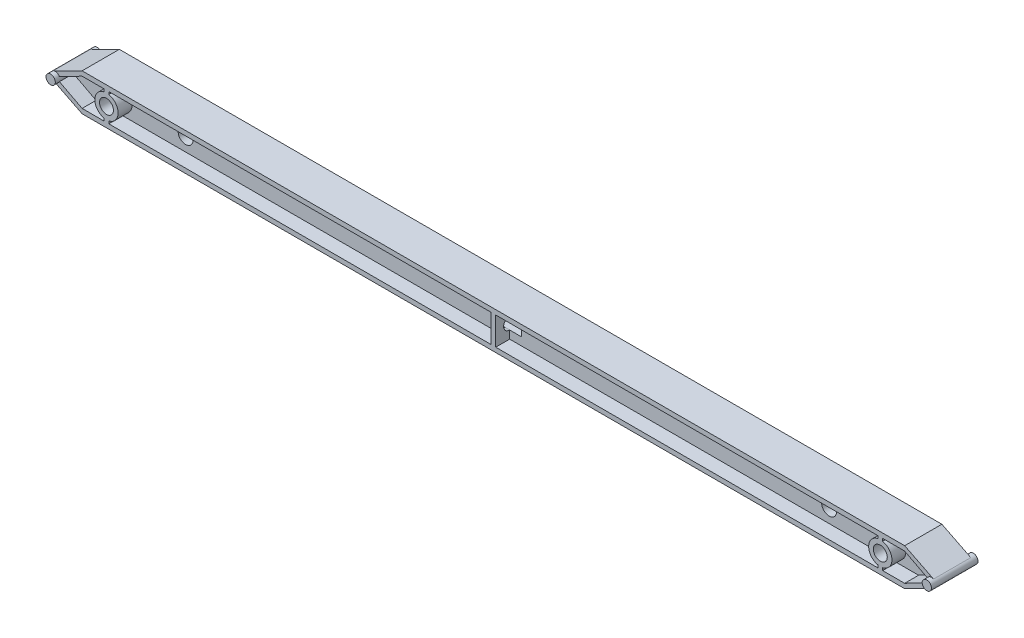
ISO-10303-21;
HEADER;
FILE_DESCRIPTION(('STEP AP214'),'2;1');
FILE_NAME('part.step','',(''),(''),'','','');
FILE_SCHEMA(('AUTOMOTIVE_DESIGN { 1 0 10303 214 1 1 1 1 }'));
ENDSEC;
DATA;
#1=APPLICATION_CONTEXT('core data for automotive mechanical design processes');
#2=APPLICATION_PROTOCOL_DEFINITION('international standard','automotive_design',2000,#1);
#3=PRODUCT_CONTEXT('',#1,'mechanical');
#4=PRODUCT('Part','Part','',(#3));
#5=PRODUCT_RELATED_PRODUCT_CATEGORY('part','',(#4));
#6=PRODUCT_DEFINITION_FORMATION('','',#4);
#7=PRODUCT_DEFINITION_CONTEXT('part definition',#1,'design');
#8=PRODUCT_DEFINITION('design','',#6,#7);
#9=PRODUCT_DEFINITION_SHAPE('','',#8);
#10=(LENGTH_UNIT() NAMED_UNIT(*) SI_UNIT(.MILLI.,.METRE.));
#11=(NAMED_UNIT(*) PLANE_ANGLE_UNIT() SI_UNIT($,.RADIAN.));
#12=(NAMED_UNIT(*) SI_UNIT($,.STERADIAN.) SOLID_ANGLE_UNIT());
#13=UNCERTAINTY_MEASURE_WITH_UNIT(LENGTH_MEASURE(1.E-05),#10,'distance_accuracy_value','');
#14=(GEOMETRIC_REPRESENTATION_CONTEXT(3) GLOBAL_UNCERTAINTY_ASSIGNED_CONTEXT((#13)) GLOBAL_UNIT_ASSIGNED_CONTEXT((#10,
#11,#12)) REPRESENTATION_CONTEXT('',''));
#15=CARTESIAN_POINT('',(0.,0.,0.));
#16=DIRECTION('',(0.,0.,1.));
#17=DIRECTION('',(1.,0.,0.));
#18=AXIS2_PLACEMENT_3D('',#15,#16,#17);
#19=CARTESIAN_POINT('',(0.,0.,3.81));
#20=DIRECTION('',(0.,0.,-1.));
#21=DIRECTION('',(-1.,0.,0.));
#22=AXIS2_PLACEMENT_3D('',#19,#20,#21);
#23=PLANE('',#22);
#24=DIRECTION('',(1.,0.,0.));
#25=VECTOR('',#24,1.);
#26=CARTESIAN_POINT('',(0.,-3.81,3.81));
#27=LINE('',#26,#25);
#28=CARTESIAN_POINT('',(154.037826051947,-3.81,3.81));
#29=VERTEX_POINT('',#28);
#30=CARTESIAN_POINT('',(160.052632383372,-3.81,3.81));
#31=VERTEX_POINT('',#30);
#32=EDGE_CURVE('E723',#29,#31,#27,.T.);
#33=ORIENTED_EDGE('',*,*,#32,.F.);
#34=DIRECTION('',(0.,-1.,0.));
#35=VECTOR('',#34,1.);
#36=CARTESIAN_POINT('',(154.037826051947,0.,3.81));
#37=LINE('',#36,#35);
#38=CARTESIAN_POINT('',(154.037826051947,-3.11085197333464,3.81));
#39=VERTEX_POINT('',#38);
#40=EDGE_CURVE('E1264',#39,#29,#37,.T.);
#41=ORIENTED_EDGE('',*,*,#40,.F.);
#42=CARTESIAN_POINT('',(153.402826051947,0.,3.81));
#43=DIRECTION('',(0.,0.,-1.));
#44=DIRECTION('',(-1.,0.,0.));
#45=AXIS2_PLACEMENT_3D('',#42,#43,#44);
#46=CIRCLE('',#45,3.175);
#47=CARTESIAN_POINT('',(154.037826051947,3.11085197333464,3.81));
#48=VERTEX_POINT('',#47);
#49=EDGE_CURVE('E479',#48,#39,#46,.T.);
#50=ORIENTED_EDGE('',*,*,#49,.F.);
#51=DIRECTION('',(0.,-1.,0.));
#52=VECTOR('',#51,1.);
#53=CARTESIAN_POINT('',(154.037826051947,0.,3.81));
#54=LINE('',#53,#52);
#55=CARTESIAN_POINT('',(154.037826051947,3.81,3.81));
#56=VERTEX_POINT('',#55);
#57=EDGE_CURVE('E475',#56,#48,#54,.T.);
#58=ORIENTED_EDGE('',*,*,#57,.F.);
#59=DIRECTION('',(-1.,0.,0.));
#60=VECTOR('',#59,1.);
#61=CARTESIAN_POINT('',(0.,3.81,3.81));
#62=LINE('',#61,#60);
#63=CARTESIAN_POINT('',(160.052632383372,3.81,3.81));
#64=VERTEX_POINT('',#63);
#65=EDGE_CURVE('E713',#64,#56,#62,.T.);
#66=ORIENTED_EDGE('',*,*,#65,.F.);
#67=DIRECTION('',(0.846193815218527,-0.532875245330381,0.));
#68=VECTOR('',#67,1.);
#69=CARTESIAN_POINT('',(47.1658985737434,74.8983782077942,3.81));
#70=LINE('',#69,#68);
#71=CARTESIAN_POINT('',(166.102826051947,6.43184507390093E-10,3.81));
#72=VERTEX_POINT('',#71);
#73=EDGE_CURVE('E716',#64,#72,#70,.T.);
#74=ORIENTED_EDGE('',*,*,#73,.T.);
#75=DIRECTION('',(0.846193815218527,0.532875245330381,0.));
#76=VECTOR('',#75,1.);
#77=CARTESIAN_POINT('',(47.1658985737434,-74.8983782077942,3.81));
#78=LINE('',#77,#76);
#79=EDGE_CURVE('E721',#31,#72,#78,.T.);
#80=ORIENTED_EDGE('',*,*,#79,.F.);
#81=EDGE_LOOP('',(#33,#41,#50,#58,#66,#74,#80));
#82=FACE_BOUND('',#81,.T.);
#83=ADVANCED_FACE('F46',(#82),#23,.T.);
#84=CARTESIAN_POINT('',(0.,3.81,3.81));
#85=DIRECTION('',(0.,-1.,0.));
#86=DIRECTION('',(0.,0.,-1.));
#87=AXIS2_PLACEMENT_3D('',#84,#85,#86);
#88=PLANE('',#87);
#89=ORIENTED_EDGE('',*,*,#65,.T.);
#90=DIRECTION('',(0.,0.,1.));
#91=VECTOR('',#90,1.);
#92=CARTESIAN_POINT('',(154.037826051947,3.81,0.));
#93=LINE('',#92,#91);
#94=CARTESIAN_POINT('',(154.037826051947,3.81,0.));
#95=VERTEX_POINT('',#94);
#96=EDGE_CURVE('E1258',#95,#56,#93,.T.);
#97=ORIENTED_EDGE('',*,*,#96,.F.);
#98=DIRECTION('',(-1.,0.,0.));
#99=VECTOR('',#98,1.);
#100=CARTESIAN_POINT('',(0.,3.81,0.));
#101=LINE('',#100,#99);
#102=CARTESIAN_POINT('',(160.052632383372,3.81,0.));
#103=VERTEX_POINT('',#102);
#104=EDGE_CURVE('E737',#103,#95,#101,.T.);
#105=ORIENTED_EDGE('',*,*,#104,.F.);
#106=DIRECTION('',(0.,0.,-1.));
#107=VECTOR('',#106,1.);
#108=CARTESIAN_POINT('',(160.052632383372,3.81,3.81));
#109=LINE('',#108,#107);
#110=EDGE_CURVE('E736',#64,#103,#109,.T.);
#111=ORIENTED_EDGE('',*,*,#110,.F.);
#112=EDGE_LOOP('',(#89,#97,#105,#111));
#113=FACE_BOUND('',#112,.T.);
#114=ADVANCED_FACE('F1072',(#113),#88,.T.);
#115=CARTESIAN_POINT('',(0.,-3.81,3.81));
#116=DIRECTION('',(0.,1.,0.));
#117=DIRECTION('',(0.,0.,1.));
#118=AXIS2_PLACEMENT_3D('',#115,#116,#117);
#119=PLANE('',#118);
#120=DIRECTION('',(1.,0.,0.));
#121=VECTOR('',#120,1.);
#122=CARTESIAN_POINT('',(0.,-3.81,0.));
#123=LINE('',#122,#121);
#124=CARTESIAN_POINT('',(154.037826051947,-3.81,0.));
#125=VERTEX_POINT('',#124);
#126=CARTESIAN_POINT('',(160.052632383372,-3.81,0.));
#127=VERTEX_POINT('',#126);
#128=EDGE_CURVE('E747',#125,#127,#123,.T.);
#129=ORIENTED_EDGE('',*,*,#128,.F.);
#130=DIRECTION('',(0.,0.,1.));
#131=VECTOR('',#130,1.);
#132=CARTESIAN_POINT('',(154.037826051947,-3.81,0.));
#133=LINE('',#132,#131);
#134=EDGE_CURVE('E460',#125,#29,#133,.T.);
#135=ORIENTED_EDGE('',*,*,#134,.T.);
#136=ORIENTED_EDGE('',*,*,#32,.T.);
#137=DIRECTION('',(0.,0.,-1.));
#138=VECTOR('',#137,1.);
#139=CARTESIAN_POINT('',(160.052632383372,-3.81,3.81));
#140=LINE('',#139,#138);
#141=EDGE_CURVE('E763',#31,#127,#140,.T.);
#142=ORIENTED_EDGE('',*,*,#141,.T.);
#143=EDGE_LOOP('',(#129,#135,#136,#142));
#144=FACE_BOUND('',#143,.T.);
#145=ADVANCED_FACE('F1079',(#144),#119,.T.);
#146=DIRECTION('',(0.,-1.,0.));
#147=VECTOR('',#146,1.);
#148=CARTESIAN_POINT('',(152.767826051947,0.,3.81));
#149=LINE('',#148,#147);
#150=CARTESIAN_POINT('',(152.767826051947,-3.11085197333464,3.81));
#151=VERTEX_POINT('',#150);
#152=CARTESIAN_POINT('',(152.767826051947,-3.81,3.81));
#153=VERTEX_POINT('',#152);
#154=EDGE_CURVE('E1266',#151,#153,#149,.T.);
#155=ORIENTED_EDGE('',*,*,#154,.T.);
#156=CARTESIAN_POINT('',(-57.1883737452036,-3.81,3.81));
#157=VERTEX_POINT('',#156);
#158=EDGE_CURVE('E728',#157,#153,#27,.T.);
#159=ORIENTED_EDGE('',*,*,#158,.F.);
#160=DIRECTION('',(0.,-1.,0.));
#161=VECTOR('',#160,1.);
#162=CARTESIAN_POINT('',(-57.1883737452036,0.,3.81));
#163=LINE('',#162,#161);
#164=CARTESIAN_POINT('',(-57.1883737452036,-3.11085197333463,3.81));
#165=VERTEX_POINT('',#164);
#166=EDGE_CURVE('E484',#165,#157,#163,.T.);
#167=ORIENTED_EDGE('',*,*,#166,.F.);
#168=CARTESIAN_POINT('',(-57.8233737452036,0.,3.81));
#169=DIRECTION('',(0.,0.,-1.));
#170=DIRECTION('',(-1.,0.,0.));
#171=AXIS2_PLACEMENT_3D('',#168,#169,#170);
#172=CIRCLE('',#171,3.175);
#173=CARTESIAN_POINT('',(-57.1883737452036,3.11085197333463,3.81));
#174=VERTEX_POINT('',#173);
#175=EDGE_CURVE('E481',#174,#165,#172,.T.);
#176=ORIENTED_EDGE('',*,*,#175,.F.);
#177=DIRECTION('',(0.,-1.,0.));
#178=VECTOR('',#177,1.);
#179=CARTESIAN_POINT('',(-57.1883737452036,0.,3.81));
#180=LINE('',#179,#178);
#181=CARTESIAN_POINT('',(-57.1883737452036,3.81,3.81));
#182=VERTEX_POINT('',#181);
#183=EDGE_CURVE('E494',#182,#174,#180,.T.);
#184=ORIENTED_EDGE('',*,*,#183,.F.);
#185=CARTESIAN_POINT('',(152.767826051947,3.81,3.81));
#186=VERTEX_POINT('',#185);
#187=EDGE_CURVE('E717',#186,#182,#62,.T.);
#188=ORIENTED_EDGE('',*,*,#187,.F.);
#189=DIRECTION('',(0.,-1.,0.));
#190=VECTOR('',#189,1.);
#191=CARTESIAN_POINT('',(152.767826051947,0.,3.81));
#192=LINE('',#191,#190);
#193=CARTESIAN_POINT('',(152.767826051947,3.11085197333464,3.81));
#194=VERTEX_POINT('',#193);
#195=EDGE_CURVE('E1272',#186,#194,#192,.T.);
#196=ORIENTED_EDGE('',*,*,#195,.T.);
#197=CARTESIAN_POINT('',(153.402826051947,0.,3.81));
#198=DIRECTION('',(0.,0.,-1.));
#199=DIRECTION('',(-1.,0.,0.));
#200=AXIS2_PLACEMENT_3D('',#197,#198,#199);
#201=CIRCLE('',#200,3.175);
#202=EDGE_CURVE('E1269',#151,#194,#201,.T.);
#203=ORIENTED_EDGE('',*,*,#202,.F.);
#204=EDGE_LOOP('',(#155,#159,#167,#176,#184,#188,#196,#203));
#205=FACE_BOUND('',#204,.T.);
#206=DIRECTION('',(-1.,0.,0.));
#207=VECTOR('',#206,1.);
#208=CARTESIAN_POINT('',(0.,-1.65100000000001,3.81));
#209=LINE('',#208,#207);
#210=CARTESIAN_POINT('',(51.5997261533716,-1.651,3.81));
#211=VERTEX_POINT('',#210);
#212=CARTESIAN_POINT('',(43.9797261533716,-1.651,3.81));
#213=VERTEX_POINT('',#212);
#214=EDGE_CURVE('E55',#211,#213,#209,.T.);
#215=ORIENTED_EDGE('',*,*,#214,.F.);
#216=DIRECTION('',(0.,1.,0.));
#217=VECTOR('',#216,1.);
#218=CARTESIAN_POINT('',(51.5997261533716,0.,3.81));
#219=LINE('',#218,#217);
#220=CARTESIAN_POINT('',(51.5997261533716,1.651,3.81));
#221=VERTEX_POINT('',#220);
#222=EDGE_CURVE('E12',#211,#221,#219,.T.);
#223=ORIENTED_EDGE('',*,*,#222,.T.);
#224=DIRECTION('',(-1.,0.,0.));
#225=VECTOR('',#224,1.);
#226=CARTESIAN_POINT('',(0.,1.65099999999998,3.81));
#227=LINE('',#226,#225);
#228=CARTESIAN_POINT('',(43.9797261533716,1.651,3.81));
#229=VERTEX_POINT('',#228);
#230=EDGE_CURVE('E855',#221,#229,#227,.T.);
#231=ORIENTED_EDGE('',*,*,#230,.T.);
#232=DIRECTION('',(0.,1.,0.));
#233=VECTOR('',#232,1.);
#234=CARTESIAN_POINT('',(43.9797261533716,0.,3.81));
#235=LINE('',#234,#233);
#236=EDGE_CURVE('E858',#213,#229,#235,.T.);
#237=ORIENTED_EDGE('',*,*,#236,.F.);
#238=EDGE_LOOP('',(#215,#223,#231,#237));
#239=FACE_BOUND('',#238,.T.);
#240=CARTESIAN_POINT('',(-40.0433737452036,0.,3.81));
#241=DIRECTION('',(0.,0.,-1.));
#242=DIRECTION('',(-1.,0.,0.));
#243=AXIS2_PLACEMENT_3D('',#240,#241,#242);
#244=CIRCLE('',#243,2.032);
#245=CARTESIAN_POINT('',(-42.0753737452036,0.,3.81));
#246=VERTEX_POINT('',#245);
#247=EDGE_CURVE('E712',#246,#246,#244,.T.);
#248=ORIENTED_EDGE('',*,*,#247,.F.);
#249=EDGE_LOOP('',(#248));
#250=FACE_BOUND('',#249,.T.);
#251=CARTESIAN_POINT('',(135.622826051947,0.,3.81));
#252=DIRECTION('',(0.,0.,-1.));
#253=DIRECTION('',(-1.,0.,0.));
#254=AXIS2_PLACEMENT_3D('',#251,#252,#253);
#255=CIRCLE('',#254,2.03200000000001);
#256=CARTESIAN_POINT('',(133.590826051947,0.,3.81));
#257=VERTEX_POINT('',#256);
#258=EDGE_CURVE('E50',#257,#257,#255,.T.);
#259=ORIENTED_EDGE('',*,*,#258,.F.);
#260=EDGE_LOOP('',(#259));
#261=FACE_BOUND('',#260,.T.);
#262=ADVANCED_FACE('F872',(#205,#239,#250,#261),#23,.T.);
#263=DIRECTION('',(0.,0.,1.));
#264=VECTOR('',#263,1.);
#265=CARTESIAN_POINT('',(152.767826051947,3.81,0.));
#266=LINE('',#265,#264);
#267=CARTESIAN_POINT('',(152.767826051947,3.81,0.));
#268=VERTEX_POINT('',#267);
#269=EDGE_CURVE('E1136',#268,#186,#266,.T.);
#270=ORIENTED_EDGE('',*,*,#269,.T.);
#271=ORIENTED_EDGE('',*,*,#187,.T.);
#272=DIRECTION('',(0.,0.,1.));
#273=VECTOR('',#272,1.);
#274=CARTESIAN_POINT('',(-57.1883737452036,3.81,0.));
#275=LINE('',#274,#273);
#276=CARTESIAN_POINT('',(-57.1883737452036,3.81,0.));
#277=VERTEX_POINT('',#276);
#278=EDGE_CURVE('E522',#277,#182,#275,.T.);
#279=ORIENTED_EDGE('',*,*,#278,.F.);
#280=EDGE_CURVE('E740',#268,#277,#101,.T.);
#281=ORIENTED_EDGE('',*,*,#280,.F.);
#282=EDGE_LOOP('',(#270,#271,#279,#281));
#283=FACE_BOUND('',#282,.T.);
#284=ADVANCED_FACE('F1082',(#283),#88,.T.);
#285=DIRECTION('',(0.,0.,1.));
#286=VECTOR('',#285,1.);
#287=CARTESIAN_POINT('',(152.767826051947,-3.81,0.));
#288=LINE('',#287,#286);
#289=CARTESIAN_POINT('',(152.767826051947,-3.81,0.));
#290=VERTEX_POINT('',#289);
#291=EDGE_CURVE('E486',#290,#153,#288,.T.);
#292=ORIENTED_EDGE('',*,*,#291,.F.);
#293=CARTESIAN_POINT('',(-57.1883737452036,-3.81,0.));
#294=VERTEX_POINT('',#293);
#295=EDGE_CURVE('E746',#294,#290,#123,.T.);
#296=ORIENTED_EDGE('',*,*,#295,.F.);
#297=DIRECTION('',(0.,0.,1.));
#298=VECTOR('',#297,1.);
#299=CARTESIAN_POINT('',(-57.1883737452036,-3.81,0.));
#300=LINE('',#299,#298);
#301=EDGE_CURVE('E70',#294,#157,#300,.T.);
#302=ORIENTED_EDGE('',*,*,#301,.T.);
#303=ORIENTED_EDGE('',*,*,#158,.T.);
#304=EDGE_LOOP('',(#292,#296,#302,#303));
#305=FACE_BOUND('',#304,.T.);
#306=ADVANCED_FACE('F1291',(#305),#119,.T.);
#307=CARTESIAN_POINT('',(0.,0.,6.35));
#308=DIRECTION('',(0.,0.,1.));
#309=DIRECTION('',(1.,0.,0.));
#310=AXIS2_PLACEMENT_3D('',#307,#308,#309);
#311=PLANE('',#310);
#312=CARTESIAN_POINT('',(-40.0433737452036,0.,6.35));
#313=DIRECTION('',(0.,0.,1.));
#314=DIRECTION('',(1.,0.,0.));
#315=AXIS2_PLACEMENT_3D('',#312,#313,#314);
#316=CIRCLE('',#315,2.032);
#317=CARTESIAN_POINT('',(-38.0113737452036,0.,6.35));
#318=VERTEX_POINT('',#317);
#319=EDGE_CURVE('E709',#318,#318,#316,.T.);
#320=ORIENTED_EDGE('',*,*,#319,.F.);
#321=EDGE_LOOP('',(#320));
#322=FACE_BOUND('',#321,.T.);
#323=DIRECTION('',(1.,0.,0.));
#324=VECTOR('',#323,1.);
#325=CARTESIAN_POINT('',(0.,-3.81,6.35));
#326=LINE('',#325,#324);
#327=CARTESIAN_POINT('',(-57.1883737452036,-3.81,6.35));
#328=VERTEX_POINT('',#327);
#329=CARTESIAN_POINT('',(47.1547261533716,-3.81,6.35));
#330=VERTEX_POINT('',#329);
#331=EDGE_CURVE('E906',#328,#330,#326,.T.);
#332=ORIENTED_EDGE('',*,*,#331,.T.);
#333=DIRECTION('',(0.,-1.,0.));
#334=VECTOR('',#333,1.);
#335=CARTESIAN_POINT('',(47.1547261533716,0.,6.35));
#336=LINE('',#335,#334);
#337=CARTESIAN_POINT('',(47.1547261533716,-1.651,6.35));
#338=VERTEX_POINT('',#337);
#339=EDGE_CURVE('E551',#338,#330,#336,.T.);
#340=ORIENTED_EDGE('',*,*,#339,.F.);
#341=DIRECTION('',(1.,0.,0.));
#342=VECTOR('',#341,1.);
#343=CARTESIAN_POINT('',(0.,-1.65100000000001,6.35));
#344=LINE('',#343,#342);
#345=CARTESIAN_POINT('',(43.9797261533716,-1.651,6.35));
#346=VERTEX_POINT('',#345);
#347=EDGE_CURVE('E695',#346,#338,#344,.T.);
#348=ORIENTED_EDGE('',*,*,#347,.F.);
#349=DIRECTION('',(0.,-1.,0.));
#350=VECTOR('',#349,1.);
#351=CARTESIAN_POINT('',(43.9797261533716,0.,6.35));
#352=LINE('',#351,#350);
#353=CARTESIAN_POINT('',(43.9797261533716,1.651,6.35));
#354=VERTEX_POINT('',#353);
#355=EDGE_CURVE('E698',#354,#346,#352,.T.);
#356=ORIENTED_EDGE('',*,*,#355,.F.);
#357=DIRECTION('',(1.,0.,0.));
#358=VECTOR('',#357,1.);
#359=CARTESIAN_POINT('',(0.,1.65099999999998,6.35));
#360=LINE('',#359,#358);
#361=CARTESIAN_POINT('',(47.1547261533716,1.65100000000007,6.35));
#362=VERTEX_POINT('',#361);
#363=EDGE_CURVE('E702',#354,#362,#360,.T.);
#364=ORIENTED_EDGE('',*,*,#363,.T.);
#365=CARTESIAN_POINT('',(47.1547261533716,3.81,6.35));
#366=VERTEX_POINT('',#365);
#367=EDGE_CURVE('E545',#366,#362,#336,.T.);
#368=ORIENTED_EDGE('',*,*,#367,.F.);
#369=DIRECTION('',(-1.,0.,0.));
#370=VECTOR('',#369,1.);
#371=CARTESIAN_POINT('',(0.,3.81,6.35));
#372=LINE('',#371,#370);
#373=CARTESIAN_POINT('',(-57.1883737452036,3.81,6.35));
#374=VERTEX_POINT('',#373);
#375=EDGE_CURVE('E1057',#366,#374,#372,.T.);
#376=ORIENTED_EDGE('',*,*,#375,.T.);
#377=DIRECTION('',(0.,-1.,0.));
#378=VECTOR('',#377,1.);
#379=CARTESIAN_POINT('',(-57.1883737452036,0.,6.35));
#380=LINE('',#379,#378);
#381=CARTESIAN_POINT('',(-57.1883737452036,3.11085197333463,6.35));
#382=VERTEX_POINT('',#381);
#383=EDGE_CURVE('E597',#374,#382,#380,.T.);
#384=ORIENTED_EDGE('',*,*,#383,.T.);
#385=CARTESIAN_POINT('',(-57.8233737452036,0.,6.35));
#386=DIRECTION('',(0.,0.,1.));
#387=DIRECTION('',(1.,0.,0.));
#388=AXIS2_PLACEMENT_3D('',#385,#386,#387);
#389=CIRCLE('',#388,3.175);
#390=CARTESIAN_POINT('',(-57.1883737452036,-3.11085197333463,6.35));
#391=VERTEX_POINT('',#390);
#392=EDGE_CURVE('E594',#391,#382,#389,.T.);
#393=ORIENTED_EDGE('',*,*,#392,.F.);
#394=DIRECTION('',(0.,-1.,0.));
#395=VECTOR('',#394,1.);
#396=CARTESIAN_POINT('',(-57.1883737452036,0.,6.35));
#397=LINE('',#396,#395);
#398=EDGE_CURVE('E592',#391,#328,#397,.T.);
#399=ORIENTED_EDGE('',*,*,#398,.T.);
#400=EDGE_LOOP('',(#332,#340,#348,#356,#364,#368,#376,#384,#393,#399));
#401=FACE_BOUND('',#400,.T.);
#402=ADVANCED_FACE('F1100',(#322,#401),#311,.T.);
#403=CARTESIAN_POINT('',(0.,-3.81,6.35));
#404=DIRECTION('',(0.,-1.,0.));
#405=DIRECTION('',(0.,0.,-1.));
#406=AXIS2_PLACEMENT_3D('',#403,#404,#405);
#407=PLANE('',#406);
#408=DIRECTION('',(0.,0.,-1.));
#409=VECTOR('',#408,1.);
#410=CARTESIAN_POINT('',(47.1547261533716,-3.81,10.16));
#411=LINE('',#410,#409);
#412=CARTESIAN_POINT('',(47.1547261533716,-3.81,10.16));
#413=VERTEX_POINT('',#412);
#414=EDGE_CURVE('E555',#413,#330,#411,.T.);
#415=ORIENTED_EDGE('',*,*,#414,.T.);
#416=ORIENTED_EDGE('',*,*,#331,.F.);
#417=DIRECTION('',(0.,0.,-1.));
#418=VECTOR('',#417,1.);
#419=CARTESIAN_POINT('',(-57.1883737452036,-3.81,10.16));
#420=LINE('',#419,#418);
#421=CARTESIAN_POINT('',(-57.1883737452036,-3.81,10.16));
#422=VERTEX_POINT('',#421);
#423=EDGE_CURVE('E615',#422,#328,#420,.T.);
#424=ORIENTED_EDGE('',*,*,#423,.F.);
#425=DIRECTION('',(1.,0.,0.));
#426=VECTOR('',#425,1.);
#427=CARTESIAN_POINT('',(0.,-3.81,10.16));
#428=LINE('',#427,#426);
#429=EDGE_CURVE('E937',#422,#413,#428,.T.);
#430=ORIENTED_EDGE('',*,*,#429,.T.);
#431=EDGE_LOOP('',(#415,#416,#424,#430));
#432=FACE_BOUND('',#431,.T.);
#433=ADVANCED_FACE('F1317',(#432),#407,.F.);
#434=CARTESIAN_POINT('',(0.,3.81,6.35));
#435=DIRECTION('',(0.,1.,0.));
#436=DIRECTION('',(0.,0.,1.));
#437=AXIS2_PLACEMENT_3D('',#434,#435,#436);
#438=PLANE('',#437);
#439=DIRECTION('',(0.,0.,-1.));
#440=VECTOR('',#439,1.);
#441=CARTESIAN_POINT('',(47.1547261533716,3.81,10.16));
#442=LINE('',#441,#440);
#443=CARTESIAN_POINT('',(47.1547261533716,3.81,10.16));
#444=VERTEX_POINT('',#443);
#445=EDGE_CURVE('E558',#444,#366,#442,.T.);
#446=ORIENTED_EDGE('',*,*,#445,.F.);
#447=DIRECTION('',(-1.,0.,0.));
#448=VECTOR('',#447,1.);
#449=CARTESIAN_POINT('',(0.,3.81,10.16));
#450=LINE('',#449,#448);
#451=CARTESIAN_POINT('',(-57.1883737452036,3.81,10.16));
#452=VERTEX_POINT('',#451);
#453=EDGE_CURVE('E933',#444,#452,#450,.T.);
#454=ORIENTED_EDGE('',*,*,#453,.T.);
#455=DIRECTION('',(0.,0.,-1.));
#456=VECTOR('',#455,1.);
#457=CARTESIAN_POINT('',(-57.1883737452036,3.81,10.16));
#458=LINE('',#457,#456);
#459=EDGE_CURVE('E606',#452,#374,#458,.T.);
#460=ORIENTED_EDGE('',*,*,#459,.T.);
#461=ORIENTED_EDGE('',*,*,#375,.F.);
#462=EDGE_LOOP('',(#446,#454,#460,#461));
#463=FACE_BOUND('',#462,.T.);
#464=ADVANCED_FACE('F1333',(#463),#438,.F.);
#465=CARTESIAN_POINT('',(-64.4731800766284,-3.81,6.35));
#466=VERTEX_POINT('',#465);
#467=CARTESIAN_POINT('',(-58.4583737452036,-3.81,6.35));
#468=VERTEX_POINT('',#467);
#469=EDGE_CURVE('E909',#466,#468,#326,.T.);
#470=ORIENTED_EDGE('',*,*,#469,.T.);
#471=DIRECTION('',(0.,-1.,0.));
#472=VECTOR('',#471,1.);
#473=CARTESIAN_POINT('',(-58.4583737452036,0.,6.35));
#474=LINE('',#473,#472);
#475=CARTESIAN_POINT('',(-58.4583737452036,-3.11085197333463,6.35));
#476=VERTEX_POINT('',#475);
#477=EDGE_CURVE('E589',#476,#468,#474,.T.);
#478=ORIENTED_EDGE('',*,*,#477,.F.);
#479=CARTESIAN_POINT('',(-57.8233737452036,0.,6.35));
#480=DIRECTION('',(0.,0.,1.));
#481=DIRECTION('',(1.,0.,0.));
#482=AXIS2_PLACEMENT_3D('',#479,#480,#481);
#483=CIRCLE('',#482,3.175);
#484=CARTESIAN_POINT('',(-58.4583737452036,3.11085197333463,6.35));
#485=VERTEX_POINT('',#484);
#486=EDGE_CURVE('E565',#485,#476,#483,.T.);
#487=ORIENTED_EDGE('',*,*,#486,.F.);
#488=DIRECTION('',(0.,-1.,0.));
#489=VECTOR('',#488,1.);
#490=CARTESIAN_POINT('',(-58.4583737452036,0.,6.35));
#491=LINE('',#490,#489);
#492=CARTESIAN_POINT('',(-58.4583737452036,3.81,6.35));
#493=VERTEX_POINT('',#492);
#494=EDGE_CURVE('E570',#493,#485,#491,.T.);
#495=ORIENTED_EDGE('',*,*,#494,.F.);
#496=CARTESIAN_POINT('',(-64.4731800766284,3.81,6.35));
#497=VERTEX_POINT('',#496);
#498=EDGE_CURVE('E1049',#493,#497,#372,.T.);
#499=ORIENTED_EDGE('',*,*,#498,.T.);
#500=DIRECTION('',(-0.887043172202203,-0.461686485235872,0.));
#501=VECTOR('',#500,1.);
#502=CARTESIAN_POINT('',(-15.3030742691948,29.4019599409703,6.35));
#503=LINE('',#502,#501);
#504=CARTESIAN_POINT('',(-70.6668289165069,0.58634183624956,6.35));
#505=VERTEX_POINT('',#504);
#506=EDGE_CURVE('E1046',#497,#505,#503,.T.);
#507=ORIENTED_EDGE('',*,*,#506,.T.);
#508=CARTESIAN_POINT('',(-71.7933737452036,0.,6.35));
#509=DIRECTION('',(0.,0.,1.));
#510=DIRECTION('',(1.,0.,0.));
#511=AXIS2_PLACEMENT_3D('',#508,#509,#510);
#512=CIRCLE('',#511,1.26999999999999);
#513=CARTESIAN_POINT('',(-70.6668289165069,-0.586341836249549,6.35));
#514=VERTEX_POINT('',#513);
#515=EDGE_CURVE('E1040',#514,#505,#512,.T.);
#516=ORIENTED_EDGE('',*,*,#515,.F.);
#517=DIRECTION('',(-0.887043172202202,0.461686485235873,0.));
#518=VECTOR('',#517,1.);
#519=CARTESIAN_POINT('',(-15.3030742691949,-29.4019599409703,6.35));
#520=LINE('',#519,#518);
#521=EDGE_CURVE('E911',#466,#514,#520,.T.);
#522=ORIENTED_EDGE('',*,*,#521,.F.);
#523=EDGE_LOOP('',(#470,#478,#487,#495,#499,#507,#516,#522));
#524=FACE_BOUND('',#523,.T.);
#525=ADVANCED_FACE('F1047',(#524),#311,.T.);
#526=DIRECTION('',(0.,0.,-1.));
#527=VECTOR('',#526,1.);
#528=CARTESIAN_POINT('',(-58.4583737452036,-3.81,10.16));
#529=LINE('',#528,#527);
#530=CARTESIAN_POINT('',(-58.4583737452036,-3.81,10.16));
#531=VERTEX_POINT('',#530);
#532=EDGE_CURVE('E618',#531,#468,#529,.T.);
#533=ORIENTED_EDGE('',*,*,#532,.T.);
#534=ORIENTED_EDGE('',*,*,#469,.F.);
#535=DIRECTION('',(0.,0.,1.));
#536=VECTOR('',#535,1.);
#537=CARTESIAN_POINT('',(-64.4731800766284,-3.81,6.35));
#538=LINE('',#537,#536);
#539=CARTESIAN_POINT('',(-64.4731800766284,-3.81,10.16));
#540=VERTEX_POINT('',#539);
#541=EDGE_CURVE('E817',#466,#540,#538,.T.);
#542=ORIENTED_EDGE('',*,*,#541,.T.);
#543=EDGE_CURVE('E934',#540,#531,#428,.T.);
#544=ORIENTED_EDGE('',*,*,#543,.T.);
#545=EDGE_LOOP('',(#533,#534,#542,#544));
#546=FACE_BOUND('',#545,.T.);
#547=ADVANCED_FACE('F1343',(#546),#407,.F.);
#548=DIRECTION('',(0.,0.,-1.));
#549=VECTOR('',#548,1.);
#550=CARTESIAN_POINT('',(-58.4583737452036,3.81,10.16));
#551=LINE('',#550,#549);
#552=CARTESIAN_POINT('',(-58.4583737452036,3.81,10.16));
#553=VERTEX_POINT('',#552);
#554=EDGE_CURVE('E603',#553,#493,#551,.T.);
#555=ORIENTED_EDGE('',*,*,#554,.F.);
#556=CARTESIAN_POINT('',(-64.4731800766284,3.81,10.16));
#557=VERTEX_POINT('',#556);
#558=EDGE_CURVE('E929',#553,#557,#450,.T.);
#559=ORIENTED_EDGE('',*,*,#558,.T.);
#560=DIRECTION('',(0.,0.,1.));
#561=VECTOR('',#560,1.);
#562=CARTESIAN_POINT('',(-64.4731800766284,3.81,6.35));
#563=LINE('',#562,#561);
#564=EDGE_CURVE('E948',#497,#557,#563,.T.);
#565=ORIENTED_EDGE('',*,*,#564,.F.);
#566=ORIENTED_EDGE('',*,*,#498,.F.);
#567=EDGE_LOOP('',(#555,#559,#565,#566));
#568=FACE_BOUND('',#567,.T.);
#569=ADVANCED_FACE('F1336',(#568),#438,.F.);
#570=DIRECTION('',(0.,-1.,0.));
#571=VECTOR('',#570,1.);
#572=CARTESIAN_POINT('',(48.4247261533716,0.,6.35));
#573=LINE('',#572,#571);
#574=CARTESIAN_POINT('',(48.4247261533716,-1.65099999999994,6.35));
#575=VERTEX_POINT('',#574);
#576=CARTESIAN_POINT('',(48.4247261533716,-3.81,6.35));
#577=VERTEX_POINT('',#576);
#578=EDGE_CURVE('E541',#575,#577,#573,.T.);
#579=ORIENTED_EDGE('',*,*,#578,.T.);
#580=CARTESIAN_POINT('',(152.767826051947,-3.81,6.35));
#581=VERTEX_POINT('',#580);
#582=EDGE_CURVE('E901',#577,#581,#326,.T.);
#583=ORIENTED_EDGE('',*,*,#582,.T.);
#584=DIRECTION('',(0.,-1.,0.));
#585=VECTOR('',#584,1.);
#586=CARTESIAN_POINT('',(152.767826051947,0.,6.35));
#587=LINE('',#586,#585);
#588=CARTESIAN_POINT('',(152.767826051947,-3.11085197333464,6.35));
#589=VERTEX_POINT('',#588);
#590=EDGE_CURVE('E647',#589,#581,#587,.T.);
#591=ORIENTED_EDGE('',*,*,#590,.F.);
#592=CARTESIAN_POINT('',(153.402826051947,0.,6.35));
#593=DIRECTION('',(0.,0.,1.));
#594=DIRECTION('',(1.,0.,0.));
#595=AXIS2_PLACEMENT_3D('',#592,#593,#594);
#596=CIRCLE('',#595,3.175);
#597=CARTESIAN_POINT('',(152.767826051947,3.11085197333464,6.35));
#598=VERTEX_POINT('',#597);
#599=EDGE_CURVE('E623',#598,#589,#596,.T.);
#600=ORIENTED_EDGE('',*,*,#599,.F.);
#601=DIRECTION('',(0.,-1.,0.));
#602=VECTOR('',#601,1.);
#603=CARTESIAN_POINT('',(152.767826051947,0.,6.35));
#604=LINE('',#603,#602);
#605=CARTESIAN_POINT('',(152.767826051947,3.81,6.35));
#606=VERTEX_POINT('',#605);
#607=EDGE_CURVE('E628',#606,#598,#604,.T.);
#608=ORIENTED_EDGE('',*,*,#607,.F.);
#609=CARTESIAN_POINT('',(48.4247261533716,3.81,6.35));
#610=VERTEX_POINT('',#609);
#611=EDGE_CURVE('E1055',#606,#610,#372,.T.);
#612=ORIENTED_EDGE('',*,*,#611,.T.);
#613=CARTESIAN_POINT('',(48.4247261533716,1.65100000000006,6.35));
#614=VERTEX_POINT('',#613);
#615=EDGE_CURVE('E548',#610,#614,#573,.T.);
#616=ORIENTED_EDGE('',*,*,#615,.T.);
#617=CARTESIAN_POINT('',(51.5997261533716,1.651,6.35));
#618=VERTEX_POINT('',#617);
#619=EDGE_CURVE('E701',#614,#618,#360,.T.);
#620=ORIENTED_EDGE('',*,*,#619,.T.);
#621=DIRECTION('',(0.,-1.,0.));
#622=VECTOR('',#621,1.);
#623=CARTESIAN_POINT('',(51.5997261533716,0.,6.35));
#624=LINE('',#623,#622);
#625=CARTESIAN_POINT('',(51.5997261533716,-1.651,6.35));
#626=VERTEX_POINT('',#625);
#627=EDGE_CURVE('E705',#618,#626,#624,.T.);
#628=ORIENTED_EDGE('',*,*,#627,.T.);
#629=EDGE_CURVE('E687',#575,#626,#344,.T.);
#630=ORIENTED_EDGE('',*,*,#629,.F.);
#631=EDGE_LOOP('',(#579,#583,#591,#600,#608,#612,#616,#620,#628,#630));
#632=FACE_BOUND('',#631,.T.);
#633=CARTESIAN_POINT('',(135.622826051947,0.,6.35));
#634=DIRECTION('',(0.,0.,1.));
#635=DIRECTION('',(1.,0.,0.));
#636=AXIS2_PLACEMENT_3D('',#633,#634,#635);
#637=CIRCLE('',#636,2.03200000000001);
#638=CARTESIAN_POINT('',(137.654826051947,0.,6.35));
#639=VERTEX_POINT('',#638);
#640=EDGE_CURVE('E681',#639,#639,#637,.T.);
#641=ORIENTED_EDGE('',*,*,#640,.F.);
#642=EDGE_LOOP('',(#641));
#643=FACE_BOUND('',#642,.T.);
#644=ADVANCED_FACE('F885',(#632,#643),#311,.T.);
#645=ORIENTED_EDGE('',*,*,#582,.F.);
#646=DIRECTION('',(0.,0.,-1.));
#647=VECTOR('',#646,1.);
#648=CARTESIAN_POINT('',(48.4247261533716,-3.81,10.16));
#649=LINE('',#648,#647);
#650=CARTESIAN_POINT('',(48.4247261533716,-3.81,10.16));
#651=VERTEX_POINT('',#650);
#652=EDGE_CURVE('E547',#651,#577,#649,.T.);
#653=ORIENTED_EDGE('',*,*,#652,.F.);
#654=CARTESIAN_POINT('',(152.767826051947,-3.81,10.16));
#655=VERTEX_POINT('',#654);
#656=EDGE_CURVE('E938',#651,#655,#428,.T.);
#657=ORIENTED_EDGE('',*,*,#656,.T.);
#658=DIRECTION('',(0.,0.,-1.));
#659=VECTOR('',#658,1.);
#660=CARTESIAN_POINT('',(152.767826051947,-3.81,10.16));
#661=LINE('',#660,#659);
#662=EDGE_CURVE('E675',#655,#581,#661,.T.);
#663=ORIENTED_EDGE('',*,*,#662,.T.);
#664=EDGE_LOOP('',(#645,#653,#657,#663));
#665=FACE_BOUND('',#664,.T.);
#666=ADVANCED_FACE('F903',(#665),#407,.F.);
#667=CARTESIAN_POINT('',(152.767826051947,3.81,10.16));
#668=VERTEX_POINT('',#667);
#669=CARTESIAN_POINT('',(48.4247261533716,3.81,10.16));
#670=VERTEX_POINT('',#669);
#671=EDGE_CURVE('E932',#668,#670,#450,.T.);
#672=ORIENTED_EDGE('',*,*,#671,.T.);
#673=DIRECTION('',(0.,0.,-1.));
#674=VECTOR('',#673,1.);
#675=CARTESIAN_POINT('',(48.4247261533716,3.81,10.16));
#676=LINE('',#675,#674);
#677=EDGE_CURVE('E561',#670,#610,#676,.T.);
#678=ORIENTED_EDGE('',*,*,#677,.T.);
#679=ORIENTED_EDGE('',*,*,#611,.F.);
#680=DIRECTION('',(0.,0.,-1.));
#681=VECTOR('',#680,1.);
#682=CARTESIAN_POINT('',(152.767826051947,3.81,10.16));
#683=LINE('',#682,#681);
#684=EDGE_CURVE('E661',#668,#606,#683,.T.);
#685=ORIENTED_EDGE('',*,*,#684,.F.);
#686=EDGE_LOOP('',(#672,#678,#679,#685));
#687=FACE_BOUND('',#686,.T.);
#688=ADVANCED_FACE('F1098',(#687),#438,.F.);
#689=DIRECTION('',(0.,-1.,0.));
#690=VECTOR('',#689,1.);
#691=CARTESIAN_POINT('',(154.037826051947,0.,6.35));
#692=LINE('',#691,#690);
#693=CARTESIAN_POINT('',(154.037826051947,-3.11085197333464,6.35));
#694=VERTEX_POINT('',#693);
#695=CARTESIAN_POINT('',(154.037826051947,-3.81,6.35));
#696=VERTEX_POINT('',#695);
#697=EDGE_CURVE('E650',#694,#696,#692,.T.);
#698=ORIENTED_EDGE('',*,*,#697,.T.);
#699=CARTESIAN_POINT('',(160.052632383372,-3.81,6.35));
#700=VERTEX_POINT('',#699);
#701=EDGE_CURVE('E907',#696,#700,#326,.T.);
#702=ORIENTED_EDGE('',*,*,#701,.T.);
#703=DIRECTION('',(0.887043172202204,0.46168648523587,0.));
#704=VECTOR('',#703,1.);
#705=CARTESIAN_POINT('',(35.6762560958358,-68.5451716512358,6.35));
#706=LINE('',#705,#704);
#707=CARTESIAN_POINT('',(166.24628122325,-0.586341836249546,6.35));
#708=VERTEX_POINT('',#707);
#709=EDGE_CURVE('E915',#700,#708,#706,.T.);
#710=ORIENTED_EDGE('',*,*,#709,.T.);
#711=CARTESIAN_POINT('',(167.372826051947,0.,6.35));
#712=DIRECTION('',(0.,0.,1.));
#713=DIRECTION('',(1.,0.,0.));
#714=AXIS2_PLACEMENT_3D('',#711,#712,#713);
#715=CIRCLE('',#714,1.27);
#716=CARTESIAN_POINT('',(166.24628122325,0.586341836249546,6.35));
#717=VERTEX_POINT('',#716);
#718=EDGE_CURVE('E797',#717,#708,#715,.T.);
#719=ORIENTED_EDGE('',*,*,#718,.F.);
#720=DIRECTION('',(0.887043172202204,-0.46168648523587,0.));
#721=VECTOR('',#720,1.);
#722=CARTESIAN_POINT('',(35.6762560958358,68.5451716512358,6.35));
#723=LINE('',#722,#721);
#724=CARTESIAN_POINT('',(160.052632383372,3.81,6.35));
#725=VERTEX_POINT('',#724);
#726=EDGE_CURVE('E1932',#725,#717,#723,.T.);
#727=ORIENTED_EDGE('',*,*,#726,.F.);
#728=CARTESIAN_POINT('',(154.037826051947,3.81,6.35));
#729=VERTEX_POINT('',#728);
#730=EDGE_CURVE('E1051',#725,#729,#372,.T.);
#731=ORIENTED_EDGE('',*,*,#730,.T.);
#732=DIRECTION('',(0.,-1.,0.));
#733=VECTOR('',#732,1.);
#734=CARTESIAN_POINT('',(154.037826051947,0.,6.35));
#735=LINE('',#734,#733);
#736=CARTESIAN_POINT('',(154.037826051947,3.11085197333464,6.35));
#737=VERTEX_POINT('',#736);
#738=EDGE_CURVE('E655',#729,#737,#735,.T.);
#739=ORIENTED_EDGE('',*,*,#738,.T.);
#740=CARTESIAN_POINT('',(153.402826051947,0.,6.35));
#741=DIRECTION('',(0.,0.,1.));
#742=DIRECTION('',(1.,0.,0.));
#743=AXIS2_PLACEMENT_3D('',#740,#741,#742);
#744=CIRCLE('',#743,3.175);
#745=EDGE_CURVE('E652',#694,#737,#744,.T.);
#746=ORIENTED_EDGE('',*,*,#745,.F.);
#747=EDGE_LOOP('',(#698,#702,#710,#719,#727,#731,#739,#746));
#748=FACE_BOUND('',#747,.T.);
#749=ADVANCED_FACE('F1091',(#748),#311,.T.);
#750=DIRECTION('',(0.,-1.,0.));
#751=VECTOR('',#750,1.);
#752=CARTESIAN_POINT('',(-58.4583737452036,0.,3.81));
#753=LINE('',#752,#751);
#754=CARTESIAN_POINT('',(-58.4583737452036,-3.11085197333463,3.81));
#755=VERTEX_POINT('',#754);
#756=CARTESIAN_POINT('',(-58.4583737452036,-3.81,3.81));
#757=VERTEX_POINT('',#756);
#758=EDGE_CURVE('E510',#755,#757,#753,.T.);
#759=ORIENTED_EDGE('',*,*,#758,.T.);
#760=CARTESIAN_POINT('',(-64.4731800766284,-3.81,3.81));
#761=VERTEX_POINT('',#760);
#762=EDGE_CURVE('E724',#761,#757,#27,.T.);
#763=ORIENTED_EDGE('',*,*,#762,.F.);
#764=DIRECTION('',(-0.887043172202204,0.461686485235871,0.));
#765=VECTOR('',#764,1.);
#766=CARTESIAN_POINT('',(-15.3030742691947,-29.4019599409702,3.81));
#767=LINE('',#766,#765);
#768=CARTESIAN_POINT('',(-70.6668289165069,-0.586341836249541,3.81));
#769=VERTEX_POINT('',#768);
#770=EDGE_CURVE('E727',#761,#769,#767,.T.);
#771=ORIENTED_EDGE('',*,*,#770,.T.);
#772=CARTESIAN_POINT('',(-71.7933737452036,0.,3.81));
#773=DIRECTION('',(0.,0.,-1.));
#774=DIRECTION('',(-1.,0.,0.));
#775=AXIS2_PLACEMENT_3D('',#772,#773,#774);
#776=CIRCLE('',#775,1.26999999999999);
#777=CARTESIAN_POINT('',(-70.6668289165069,0.586341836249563,3.81));
#778=VERTEX_POINT('',#777);
#779=EDGE_CURVE('E731',#769,#778,#776,.F.);
#780=ORIENTED_EDGE('',*,*,#779,.T.);
#781=DIRECTION('',(-0.887043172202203,-0.461686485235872,0.));
#782=VECTOR('',#781,1.);
#783=CARTESIAN_POINT('',(-15.3030742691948,29.4019599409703,3.81));
#784=LINE('',#783,#782);
#785=CARTESIAN_POINT('',(-64.4731800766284,3.81,3.81));
#786=VERTEX_POINT('',#785);
#787=EDGE_CURVE('E734',#786,#778,#784,.T.);
#788=ORIENTED_EDGE('',*,*,#787,.F.);
#789=CARTESIAN_POINT('',(-58.4583737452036,3.81,3.81));
#790=VERTEX_POINT('',#789);
#791=EDGE_CURVE('E718',#790,#786,#62,.T.);
#792=ORIENTED_EDGE('',*,*,#791,.F.);
#793=DIRECTION('',(0.,-1.,0.));
#794=VECTOR('',#793,1.);
#795=CARTESIAN_POINT('',(-58.4583737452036,0.,3.81));
#796=LINE('',#795,#794);
#797=CARTESIAN_POINT('',(-58.4583737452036,3.11085197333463,3.81));
#798=VERTEX_POINT('',#797);
#799=EDGE_CURVE('E516',#790,#798,#796,.T.);
#800=ORIENTED_EDGE('',*,*,#799,.T.);
#801=CARTESIAN_POINT('',(-57.8233737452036,0.,3.81));
#802=DIRECTION('',(0.,0.,-1.));
#803=DIRECTION('',(-1.,0.,0.));
#804=AXIS2_PLACEMENT_3D('',#801,#802,#803);
#805=CIRCLE('',#804,3.175);
#806=EDGE_CURVE('E513',#755,#798,#805,.T.);
#807=ORIENTED_EDGE('',*,*,#806,.F.);
#808=EDGE_LOOP('',(#759,#763,#771,#780,#788,#792,#800,#807));
#809=FACE_BOUND('',#808,.T.);
#810=ADVANCED_FACE('F1075',(#809),#23,.T.);
#811=CARTESIAN_POINT('',(34.0425264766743,-68.0850529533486,10.16));
#812=DIRECTION('',(-0.447213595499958,0.894427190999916,0.));
#813=DIRECTION('',(-0.894427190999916,-0.447213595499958,0.));
#814=AXIS2_PLACEMENT_3D('',#811,#812,#813);
#815=PLANE('',#814);
#816=DIRECTION('',(0.,0.,1.));
#817=VECTOR('',#816,1.);
#818=CARTESIAN_POINT('',(167.940787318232,-1.13592253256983,0.));
#819=LINE('',#818,#817);
#820=CARTESIAN_POINT('',(167.940787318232,-1.13592253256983,0.));
#821=VERTEX_POINT('',#820);
#822=CARTESIAN_POINT('',(167.940787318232,-1.13592253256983,10.16));
#823=VERTEX_POINT('',#822);
#824=EDGE_CURVE('E1001',#821,#823,#819,.T.);
#825=ORIENTED_EDGE('',*,*,#824,.T.);
#826=DIRECTION('',(0.894427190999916,0.447213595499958,0.));
#827=VECTOR('',#826,1.);
#828=CARTESIAN_POINT('',(34.0425264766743,-68.0850529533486,10.16));
#829=LINE('',#828,#827);
#830=CARTESIAN_POINT('',(160.052632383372,-5.08,10.16));
#831=VERTEX_POINT('',#830);
#832=EDGE_CURVE('E959',#831,#823,#829,.T.);
#833=ORIENTED_EDGE('',*,*,#832,.F.);
#834=DIRECTION('',(0.,0.,-1.));
#835=VECTOR('',#834,1.);
#836=CARTESIAN_POINT('',(160.052632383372,-5.08,10.16));
#837=LINE('',#836,#835);
#838=CARTESIAN_POINT('',(160.052632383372,-5.08,0.));
#839=VERTEX_POINT('',#838);
#840=EDGE_CURVE('E980',#831,#839,#837,.T.);
#841=ORIENTED_EDGE('',*,*,#840,.T.);
#842=DIRECTION('',(0.894427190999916,0.447213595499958,0.));
#843=VECTOR('',#842,1.);
#844=CARTESIAN_POINT('',(34.0425264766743,-68.0850529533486,0.));
#845=LINE('',#844,#843);
#846=EDGE_CURVE('E974',#839,#821,#845,.T.);
#847=ORIENTED_EDGE('',*,*,#846,.T.);
#848=EDGE_LOOP('',(#825,#833,#841,#847));
#849=FACE_BOUND('',#848,.T.);
#850=ADVANCED_FACE('F1090',(#849),#815,.F.);
#851=CARTESIAN_POINT('',(34.0425264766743,68.0850529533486,10.16));
#852=DIRECTION('',(0.447213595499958,0.894427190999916,0.));
#853=DIRECTION('',(-0.894427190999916,0.447213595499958,0.));
#854=AXIS2_PLACEMENT_3D('',#851,#852,#853);
#855=PLANE('',#854);
#856=DIRECTION('',(0.894427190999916,-0.447213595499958,0.));
#857=VECTOR('',#856,1.);
#858=CARTESIAN_POINT('',(34.0425264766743,68.0850529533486,10.16));
#859=LINE('',#858,#857);
#860=CARTESIAN_POINT('',(160.052632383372,5.08,10.16));
#861=VERTEX_POINT('',#860);
#862=CARTESIAN_POINT('',(167.940787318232,1.13592253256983,10.16));
#863=VERTEX_POINT('',#862);
#864=EDGE_CURVE('E962',#861,#863,#859,.T.);
#865=ORIENTED_EDGE('',*,*,#864,.T.);
#866=DIRECTION('',(0.,0.,1.));
#867=VECTOR('',#866,1.);
#868=CARTESIAN_POINT('',(167.940787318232,1.13592253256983,0.));
#869=LINE('',#868,#867);
#870=CARTESIAN_POINT('',(167.940787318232,1.1359225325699,0.));
#871=VERTEX_POINT('',#870);
#872=EDGE_CURVE('E780',#871,#863,#869,.T.);
#873=ORIENTED_EDGE('',*,*,#872,.F.);
#874=DIRECTION('',(0.894427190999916,-0.447213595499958,0.));
#875=VECTOR('',#874,1.);
#876=CARTESIAN_POINT('',(34.0425264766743,68.0850529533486,0.));
#877=LINE('',#876,#875);
#878=CARTESIAN_POINT('',(160.052632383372,5.08,0.));
#879=VERTEX_POINT('',#878);
#880=EDGE_CURVE('E829',#879,#871,#877,.T.);
#881=ORIENTED_EDGE('',*,*,#880,.F.);
#882=DIRECTION('',(0.,0.,-1.));
#883=VECTOR('',#882,1.);
#884=CARTESIAN_POINT('',(160.052632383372,5.08,10.16));
#885=LINE('',#884,#883);
#886=EDGE_CURVE('E979',#861,#879,#885,.T.);
#887=ORIENTED_EDGE('',*,*,#886,.F.);
#888=EDGE_LOOP('',(#865,#873,#881,#887));
#889=FACE_BOUND('',#888,.T.);
#890=ADVANCED_FACE('F1022',(#889),#855,.T.);
#891=CARTESIAN_POINT('',(0.,0.,10.16));
#892=DIRECTION('',(0.,0.,1.));
#893=DIRECTION('',(1.,0.,0.));
#894=AXIS2_PLACEMENT_3D('',#891,#892,#893);
#895=PLANE('',#894);
#896=ORIENTED_EDGE('',*,*,#453,.F.);
#897=DIRECTION('',(0.,-1.,0.));
#898=VECTOR('',#897,1.);
#899=CARTESIAN_POINT('',(47.1547261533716,0.,10.16));
#900=LINE('',#899,#898);
#901=EDGE_CURVE('E544',#444,#413,#900,.T.);
#902=ORIENTED_EDGE('',*,*,#901,.T.);
#903=ORIENTED_EDGE('',*,*,#429,.F.);
#904=DIRECTION('',(0.,-1.,0.));
#905=VECTOR('',#904,1.);
#906=CARTESIAN_POINT('',(-57.1883737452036,0.,10.16));
#907=LINE('',#906,#905);
#908=CARTESIAN_POINT('',(-57.1883737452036,-3.11085197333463,10.16));
#909=VERTEX_POINT('',#908);
#910=EDGE_CURVE('E573',#909,#422,#907,.T.);
#911=ORIENTED_EDGE('',*,*,#910,.F.);
#912=CARTESIAN_POINT('',(-57.8233737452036,0.,10.16));
#913=DIRECTION('',(0.,0.,1.));
#914=DIRECTION('',(1.,0.,0.));
#915=AXIS2_PLACEMENT_3D('',#912,#913,#914);
#916=CIRCLE('',#915,3.175);
#917=CARTESIAN_POINT('',(-57.1883737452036,3.11085197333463,10.16));
#918=VERTEX_POINT('',#917);
#919=EDGE_CURVE('E576',#909,#918,#916,.T.);
#920=ORIENTED_EDGE('',*,*,#919,.T.);
#921=DIRECTION('',(0.,-1.,0.));
#922=VECTOR('',#921,1.);
#923=CARTESIAN_POINT('',(-57.1883737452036,0.,10.16));
#924=LINE('',#923,#922);
#925=EDGE_CURVE('E578',#452,#918,#924,.T.);
#926=ORIENTED_EDGE('',*,*,#925,.F.);
#927=EDGE_LOOP('',(#896,#902,#903,#911,#920,#926));
#928=FACE_BOUND('',#927,.T.);
#929=DIRECTION('',(0.,-1.,0.));
#930=VECTOR('',#929,1.);
#931=CARTESIAN_POINT('',(48.4247261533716,0.,10.16));
#932=LINE('',#931,#930);
#933=EDGE_CURVE('E542',#670,#651,#932,.T.);
#934=ORIENTED_EDGE('',*,*,#933,.F.);
#935=ORIENTED_EDGE('',*,*,#671,.F.);
#936=DIRECTION('',(0.,-1.,0.));
#937=VECTOR('',#936,1.);
#938=CARTESIAN_POINT('',(152.767826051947,0.,10.16));
#939=LINE('',#938,#937);
#940=CARTESIAN_POINT('',(152.767826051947,3.11085197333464,10.16));
#941=VERTEX_POINT('',#940);
#942=EDGE_CURVE('E639',#668,#941,#939,.T.);
#943=ORIENTED_EDGE('',*,*,#942,.T.);
#944=CARTESIAN_POINT('',(153.402826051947,0.,10.16));
#945=DIRECTION('',(0.,0.,1.));
#946=DIRECTION('',(1.,0.,0.));
#947=AXIS2_PLACEMENT_3D('',#944,#945,#946);
#948=CIRCLE('',#947,3.175);
#949=CARTESIAN_POINT('',(152.767826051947,-3.11085197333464,10.16));
#950=VERTEX_POINT('',#949);
#951=EDGE_CURVE('E624',#941,#950,#948,.T.);
#952=ORIENTED_EDGE('',*,*,#951,.T.);
#953=DIRECTION('',(0.,-1.,0.));
#954=VECTOR('',#953,1.);
#955=CARTESIAN_POINT('',(152.767826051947,0.,10.16));
#956=LINE('',#955,#954);
#957=EDGE_CURVE('E627',#950,#655,#956,.T.);
#958=ORIENTED_EDGE('',*,*,#957,.T.);
#959=ORIENTED_EDGE('',*,*,#656,.F.);
#960=EDGE_LOOP('',(#934,#935,#943,#952,#958,#959));
#961=FACE_BOUND('',#960,.T.);
#962=DIRECTION('',(0.887043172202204,-0.46168648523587,0.));
#963=VECTOR('',#962,1.);
#964=CARTESIAN_POINT('',(35.6762560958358,68.5451716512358,10.16));
#965=LINE('',#964,#963);
#966=CARTESIAN_POINT('',(160.052632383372,3.81,10.16));
#967=VERTEX_POINT('',#966);
#968=CARTESIAN_POINT('',(166.24628122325,0.58634183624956,10.16));
#969=VERTEX_POINT('',#968);
#970=EDGE_CURVE('E793',#967,#969,#965,.T.);
#971=ORIENTED_EDGE('',*,*,#970,.T.);
#972=CARTESIAN_POINT('',(167.372826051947,0.,10.16));
#973=DIRECTION('',(0.,0.,1.));
#974=DIRECTION('',(1.,0.,0.));
#975=AXIS2_PLACEMENT_3D('',#972,#973,#974);
#976=CIRCLE('',#975,1.27);
#977=EDGE_CURVE('E786',#863,#969,#976,.T.);
#978=ORIENTED_EDGE('',*,*,#977,.F.);
#979=ORIENTED_EDGE('',*,*,#864,.F.);
#980=DIRECTION('',(1.,0.,0.));
#981=VECTOR('',#980,1.);
#982=CARTESIAN_POINT('',(0.,5.08,10.16));
#983=LINE('',#982,#981);
#984=CARTESIAN_POINT('',(-64.4731800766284,5.08,10.16));
#985=VERTEX_POINT('',#984);
#986=EDGE_CURVE('E965',#985,#861,#983,.T.);
#987=ORIENTED_EDGE('',*,*,#986,.F.);
#988=DIRECTION('',(0.894427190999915,0.447213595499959,0.));
#989=VECTOR('',#988,1.);
#990=CARTESIAN_POINT('',(-14.9266360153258,29.8532720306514,10.16));
#991=LINE('',#990,#989);
#992=CARTESIAN_POINT('',(-72.3613350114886,1.13592253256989,10.16));
#993=VERTEX_POINT('',#992);
#994=EDGE_CURVE('E952',#993,#985,#991,.T.);
#995=ORIENTED_EDGE('',*,*,#994,.F.);
#996=CARTESIAN_POINT('',(-71.7933737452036,0.,10.16));
#997=DIRECTION('',(0.,0.,1.));
#998=DIRECTION('',(1.,0.,0.));
#999=AXIS2_PLACEMENT_3D('',#996,#997,#998);
#1000=CIRCLE('',#999,1.26999999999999);
#1001=CARTESIAN_POINT('',(-70.6668289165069,0.586341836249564,10.16));
#1002=VERTEX_POINT('',#1001);
#1003=EDGE_CURVE('E785',#1002,#993,#1000,.T.);
#1004=ORIENTED_EDGE('',*,*,#1003,.F.);
#1005=DIRECTION('',(-0.887043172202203,-0.461686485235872,0.));
#1006=VECTOR('',#1005,1.);
#1007=CARTESIAN_POINT('',(-15.3030742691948,29.4019599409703,10.16));
#1008=LINE('',#1007,#1006);
#1009=EDGE_CURVE('E804',#557,#1002,#1008,.T.);
#1010=ORIENTED_EDGE('',*,*,#1009,.F.);
#1011=ORIENTED_EDGE('',*,*,#558,.F.);
#1012=DIRECTION('',(0.,-1.,0.));
#1013=VECTOR('',#1012,1.);
#1014=CARTESIAN_POINT('',(-58.4583737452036,0.,10.16));
#1015=LINE('',#1014,#1013);
#1016=CARTESIAN_POINT('',(-58.4583737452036,3.11085197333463,10.16));
#1017=VERTEX_POINT('',#1016);
#1018=EDGE_CURVE('E581',#553,#1017,#1015,.T.);
#1019=ORIENTED_EDGE('',*,*,#1018,.T.);
#1020=CARTESIAN_POINT('',(-57.8233737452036,0.,10.16));
#1021=DIRECTION('',(0.,0.,1.));
#1022=DIRECTION('',(1.,0.,0.));
#1023=AXIS2_PLACEMENT_3D('',#1020,#1021,#1022);
#1024=CIRCLE('',#1023,3.175);
#1025=CARTESIAN_POINT('',(-58.4583737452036,-3.11085197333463,10.16));
#1026=VERTEX_POINT('',#1025);
#1027=EDGE_CURVE('E566',#1017,#1026,#1024,.T.);
#1028=ORIENTED_EDGE('',*,*,#1027,.T.);
#1029=DIRECTION('',(0.,-1.,0.));
#1030=VECTOR('',#1029,1.);
#1031=CARTESIAN_POINT('',(-58.4583737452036,0.,10.16));
#1032=LINE('',#1031,#1030);
#1033=EDGE_CURVE('E569',#1026,#531,#1032,.T.);
#1034=ORIENTED_EDGE('',*,*,#1033,.T.);
#1035=ORIENTED_EDGE('',*,*,#543,.F.);
#1036=DIRECTION('',(-0.887043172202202,0.461686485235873,0.));
#1037=VECTOR('',#1036,1.);
#1038=CARTESIAN_POINT('',(-15.3030742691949,-29.4019599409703,10.16));
#1039=LINE('',#1038,#1037);
#1040=CARTESIAN_POINT('',(-70.6668289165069,-0.586341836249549,10.16));
#1041=VERTEX_POINT('',#1040);
#1042=EDGE_CURVE('E821',#540,#1041,#1039,.T.);
#1043=ORIENTED_EDGE('',*,*,#1042,.T.);
#1044=CARTESIAN_POINT('',(-72.3613350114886,-1.13592253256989,10.16));
#1045=VERTEX_POINT('',#1044);
#1046=EDGE_CURVE('E808',#1045,#1041,#1000,.T.);
#1047=ORIENTED_EDGE('',*,*,#1046,.F.);
#1048=DIRECTION('',(0.894427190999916,-0.447213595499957,0.));
#1049=VECTOR('',#1048,1.);
#1050=CARTESIAN_POINT('',(-14.9266360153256,-29.8532720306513,10.16));
#1051=LINE('',#1050,#1049);
#1052=CARTESIAN_POINT('',(-64.4731800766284,-5.08,10.16));
#1053=VERTEX_POINT('',#1052);
#1054=EDGE_CURVE('E954',#1045,#1053,#1051,.T.);
#1055=ORIENTED_EDGE('',*,*,#1054,.T.);
#1056=DIRECTION('',(1.,0.,0.));
#1057=VECTOR('',#1056,1.);
#1058=CARTESIAN_POINT('',(0.,-5.08,10.16));
#1059=LINE('',#1058,#1057);
#1060=EDGE_CURVE('E957',#1053,#831,#1059,.T.);
#1061=ORIENTED_EDGE('',*,*,#1060,.T.);
#1062=ORIENTED_EDGE('',*,*,#832,.T.);
#1063=CARTESIAN_POINT('',(166.24628122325,-0.586341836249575,10.16));
#1064=VERTEX_POINT('',#1063);
#1065=EDGE_CURVE('E789',#1064,#823,#976,.T.);
#1066=ORIENTED_EDGE('',*,*,#1065,.F.);
#1067=DIRECTION('',(0.887043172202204,0.46168648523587,0.));
#1068=VECTOR('',#1067,1.);
#1069=CARTESIAN_POINT('',(35.6762560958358,-68.5451716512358,10.16));
#1070=LINE('',#1069,#1068);
#1071=CARTESIAN_POINT('',(160.052632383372,-3.81,10.16));
#1072=VERTEX_POINT('',#1071);
#1073=EDGE_CURVE('E936',#1072,#1064,#1070,.T.);
#1074=ORIENTED_EDGE('',*,*,#1073,.F.);
#1075=CARTESIAN_POINT('',(154.037826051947,-3.81,10.16));
#1076=VERTEX_POINT('',#1075);
#1077=EDGE_CURVE('E824',#1076,#1072,#428,.T.);
#1078=ORIENTED_EDGE('',*,*,#1077,.F.);
#1079=DIRECTION('',(0.,-1.,0.));
#1080=VECTOR('',#1079,1.);
#1081=CARTESIAN_POINT('',(154.037826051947,0.,10.16));
#1082=LINE('',#1081,#1080);
#1083=CARTESIAN_POINT('',(154.037826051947,-3.11085197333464,10.16));
#1084=VERTEX_POINT('',#1083);
#1085=EDGE_CURVE('E631',#1084,#1076,#1082,.T.);
#1086=ORIENTED_EDGE('',*,*,#1085,.F.);
#1087=CARTESIAN_POINT('',(153.402826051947,0.,10.16));
#1088=DIRECTION('',(0.,0.,1.));
#1089=DIRECTION('',(1.,0.,0.));
#1090=AXIS2_PLACEMENT_3D('',#1087,#1088,#1089);
#1091=CIRCLE('',#1090,3.175);
#1092=CARTESIAN_POINT('',(154.037826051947,3.11085197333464,10.16));
#1093=VERTEX_POINT('',#1092);
#1094=EDGE_CURVE('E634',#1084,#1093,#1091,.T.);
#1095=ORIENTED_EDGE('',*,*,#1094,.T.);
#1096=DIRECTION('',(0.,-1.,0.));
#1097=VECTOR('',#1096,1.);
#1098=CARTESIAN_POINT('',(154.037826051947,0.,10.16));
#1099=LINE('',#1098,#1097);
#1100=CARTESIAN_POINT('',(154.037826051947,3.81,10.16));
#1101=VERTEX_POINT('',#1100);
#1102=EDGE_CURVE('E636',#1101,#1093,#1099,.T.);
#1103=ORIENTED_EDGE('',*,*,#1102,.F.);
#1104=EDGE_CURVE('E930',#967,#1101,#450,.T.);
#1105=ORIENTED_EDGE('',*,*,#1104,.F.);
#1106=EDGE_LOOP('',(#971,#978,#979,#987,#995,#1004,#1010,#1011,#1019,#1028,#1034,#1035,#1043,
#1047,#1055,#1061,#1062,#1066,#1074,#1078,#1086,#1095,#1103,#1105));
#1107=FACE_BOUND('',#1106,.T.);
#1108=CARTESIAN_POINT('',(153.402826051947,0.,10.16));
#1109=DIRECTION('',(0.,0.,1.));
#1110=DIRECTION('',(1.,0.,0.));
#1111=AXIS2_PLACEMENT_3D('',#1108,#1109,#1110);
#1112=CIRCLE('',#1111,1.90500000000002);
#1113=CARTESIAN_POINT('',(155.307826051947,0.,10.16));
#1114=VERTEX_POINT('',#1113);
#1115=EDGE_CURVE('E641',#1114,#1114,#1112,.F.);
#1116=ORIENTED_EDGE('',*,*,#1115,.T.);
#1117=EDGE_LOOP('',(#1116));
#1118=FACE_BOUND('',#1117,.T.);
#1119=CARTESIAN_POINT('',(-57.8233737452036,0.,10.16));
#1120=DIRECTION('',(0.,0.,1.));
#1121=DIRECTION('',(1.,0.,0.));
#1122=AXIS2_PLACEMENT_3D('',#1119,#1120,#1121);
#1123=CIRCLE('',#1122,1.905);
#1124=CARTESIAN_POINT('',(-55.9183737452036,0.,10.16));
#1125=VERTEX_POINT('',#1124);
#1126=EDGE_CURVE('E583',#1125,#1125,#1123,.F.);
#1127=ORIENTED_EDGE('',*,*,#1126,.T.);
#1128=EDGE_LOOP('',(#1127));
#1129=FACE_BOUND('',#1128,.T.);
#1130=ADVANCED_FACE('F1017',(#928,#961,#1107,#1118,#1129),#895,.T.);
#1131=CARTESIAN_POINT('',(-14.9266360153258,29.8532720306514,10.16));
#1132=DIRECTION('',(-0.447213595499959,0.894427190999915,0.));
#1133=DIRECTION('',(-0.894427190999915,-0.447213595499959,0.));
#1134=AXIS2_PLACEMENT_3D('',#1131,#1132,#1133);
#1135=PLANE('',#1134);
#1136=DIRECTION('',(0.,0.,1.));
#1137=VECTOR('',#1136,1.);
#1138=CARTESIAN_POINT('',(-72.3613350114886,1.13592253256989,0.));
#1139=LINE('',#1138,#1137);
#1140=CARTESIAN_POINT('',(-72.3613350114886,1.13592253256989,0.));
#1141=VERTEX_POINT('',#1140);
#1142=EDGE_CURVE('E777',#1141,#993,#1139,.T.);
#1143=ORIENTED_EDGE('',*,*,#1142,.T.);
#1144=ORIENTED_EDGE('',*,*,#994,.T.);
#1145=DIRECTION('',(0.,0.,-1.));
#1146=VECTOR('',#1145,1.);
#1147=CARTESIAN_POINT('',(-64.4731800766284,5.08,10.16));
#1148=LINE('',#1147,#1146);
#1149=CARTESIAN_POINT('',(-64.4731800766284,5.08,0.));
#1150=VERTEX_POINT('',#1149);
#1151=EDGE_CURVE('E968',#985,#1150,#1148,.T.);
#1152=ORIENTED_EDGE('',*,*,#1151,.T.);
#1153=DIRECTION('',(0.894427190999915,0.447213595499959,0.));
#1154=VECTOR('',#1153,1.);
#1155=CARTESIAN_POINT('',(-14.9266360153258,29.8532720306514,0.));
#1156=LINE('',#1155,#1154);
#1157=EDGE_CURVE('E943',#1141,#1150,#1156,.T.);
#1158=ORIENTED_EDGE('',*,*,#1157,.F.);
#1159=EDGE_LOOP('',(#1143,#1144,#1152,#1158));
#1160=FACE_BOUND('',#1159,.T.);
#1161=ADVANCED_FACE('F48',(#1160),#1135,.T.);
#1162=CARTESIAN_POINT('',(-14.9266360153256,-29.8532720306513,10.16));
#1163=DIRECTION('',(0.447213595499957,0.894427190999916,0.));
#1164=DIRECTION('',(-0.894427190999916,0.447213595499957,0.));
#1165=AXIS2_PLACEMENT_3D('',#1162,#1163,#1164);
#1166=PLANE('',#1165);
#1167=ORIENTED_EDGE('',*,*,#1054,.F.);
#1168=DIRECTION('',(0.,0.,1.));
#1169=VECTOR('',#1168,1.);
#1170=CARTESIAN_POINT('',(-72.3613350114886,-1.13592253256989,0.));
#1171=LINE('',#1170,#1169);
#1172=CARTESIAN_POINT('',(-72.3613350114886,-1.13592253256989,0.));
#1173=VERTEX_POINT('',#1172);
#1174=EDGE_CURVE('E778',#1173,#1045,#1171,.T.);
#1175=ORIENTED_EDGE('',*,*,#1174,.F.);
#1176=DIRECTION('',(0.894427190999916,-0.447213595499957,0.));
#1177=VECTOR('',#1176,1.);
#1178=CARTESIAN_POINT('',(-14.9266360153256,-29.8532720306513,0.));
#1179=LINE('',#1178,#1177);
#1180=CARTESIAN_POINT('',(-64.4731800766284,-5.08,0.));
#1181=VERTEX_POINT('',#1180);
#1182=EDGE_CURVE('E970',#1173,#1181,#1179,.T.);
#1183=ORIENTED_EDGE('',*,*,#1182,.T.);
#1184=DIRECTION('',(0.,0.,-1.));
#1185=VECTOR('',#1184,1.);
#1186=CARTESIAN_POINT('',(-64.4731800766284,-5.08,10.16));
#1187=LINE('',#1186,#1185);
#1188=EDGE_CURVE('E802',#1053,#1181,#1187,.T.);
#1189=ORIENTED_EDGE('',*,*,#1188,.F.);
#1190=EDGE_LOOP('',(#1167,#1175,#1183,#1189));
#1191=FACE_BOUND('',#1190,.T.);
#1192=ADVANCED_FACE('F1064',(#1191),#1166,.F.);
#1193=CARTESIAN_POINT('',(0.,-5.08,10.16));
#1194=DIRECTION('',(0.,1.,0.));
#1195=DIRECTION('',(0.,0.,1.));
#1196=AXIS2_PLACEMENT_3D('',#1193,#1194,#1195);
#1197=PLANE('',#1196);
#1198=DIRECTION('',(1.,0.,0.));
#1199=VECTOR('',#1198,1.);
#1200=CARTESIAN_POINT('',(0.,-5.08,0.));
#1201=LINE('',#1200,#1199);
#1202=EDGE_CURVE('E972',#1181,#839,#1201,.T.);
#1203=ORIENTED_EDGE('',*,*,#1202,.T.);
#1204=ORIENTED_EDGE('',*,*,#840,.F.);
#1205=ORIENTED_EDGE('',*,*,#1060,.F.);
#1206=ORIENTED_EDGE('',*,*,#1188,.T.);
#1207=EDGE_LOOP('',(#1203,#1204,#1205,#1206));
#1208=FACE_BOUND('',#1207,.T.);
#1209=ADVANCED_FACE('F992',(#1208),#1197,.F.);
#1210=CARTESIAN_POINT('',(0.,5.08,10.16));
#1211=DIRECTION('',(0.,1.,0.));
#1212=DIRECTION('',(0.,0.,1.));
#1213=AXIS2_PLACEMENT_3D('',#1210,#1211,#1212);
#1214=PLANE('',#1213);
#1215=DIRECTION('',(1.,0.,0.));
#1216=VECTOR('',#1215,1.);
#1217=CARTESIAN_POINT('',(0.,5.08,0.));
#1218=LINE('',#1217,#1216);
#1219=EDGE_CURVE('E955',#1150,#879,#1218,.T.);
#1220=ORIENTED_EDGE('',*,*,#1219,.F.);
#1221=ORIENTED_EDGE('',*,*,#1151,.F.);
#1222=ORIENTED_EDGE('',*,*,#986,.T.);
#1223=ORIENTED_EDGE('',*,*,#886,.T.);
#1224=EDGE_LOOP('',(#1220,#1221,#1222,#1223));
#1225=FACE_BOUND('',#1224,.T.);
#1226=ADVANCED_FACE('F1025',(#1225),#1214,.T.);
#1227=CARTESIAN_POINT('',(0.,0.,0.));
#1228=DIRECTION('',(0.,0.,1.));
#1229=DIRECTION('',(1.,0.,0.));
#1230=AXIS2_PLACEMENT_3D('',#1227,#1228,#1229);
#1231=PLANE('',#1230);
#1232=ORIENTED_EDGE('',*,*,#295,.T.);
#1233=DIRECTION('',(0.,-1.,0.));
#1234=VECTOR('',#1233,1.);
#1235=CARTESIAN_POINT('',(152.767826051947,0.,0.));
#1236=LINE('',#1235,#1234);
#1237=CARTESIAN_POINT('',(152.767826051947,-3.11085197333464,0.));
#1238=VERTEX_POINT('',#1237);
#1239=EDGE_CURVE('E463',#1238,#290,#1236,.T.);
#1240=ORIENTED_EDGE('',*,*,#1239,.F.);
#1241=CARTESIAN_POINT('',(153.402826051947,0.,0.));
#1242=DIRECTION('',(0.,0.,-1.));
#1243=DIRECTION('',(-1.,0.,0.));
#1244=AXIS2_PLACEMENT_3D('',#1241,#1242,#1243);
#1245=CIRCLE('',#1244,3.175);
#1246=CARTESIAN_POINT('',(152.767826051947,3.11085197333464,0.));
#1247=VERTEX_POINT('',#1246);
#1248=EDGE_CURVE('E2049',#1238,#1247,#1245,.T.);
#1249=ORIENTED_EDGE('',*,*,#1248,.T.);
#1250=DIRECTION('',(0.,-1.,0.));
#1251=VECTOR('',#1250,1.);
#1252=CARTESIAN_POINT('',(152.767826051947,0.,0.));
#1253=LINE('',#1252,#1251);
#1254=EDGE_CURVE('E62',#268,#1247,#1253,.T.);
#1255=ORIENTED_EDGE('',*,*,#1254,.F.);
#1256=ORIENTED_EDGE('',*,*,#280,.T.);
#1257=DIRECTION('',(0.,-1.,0.));
#1258=VECTOR('',#1257,1.);
#1259=CARTESIAN_POINT('',(-57.1883737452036,0.,0.));
#1260=LINE('',#1259,#1258);
#1261=CARTESIAN_POINT('',(-57.1883737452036,3.11085197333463,0.));
#1262=VERTEX_POINT('',#1261);
#1263=EDGE_CURVE('E503',#277,#1262,#1260,.T.);
#1264=ORIENTED_EDGE('',*,*,#1263,.T.);
#1265=CARTESIAN_POINT('',(-57.8233737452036,0.,0.));
#1266=DIRECTION('',(0.,0.,-1.));
#1267=DIRECTION('',(-1.,0.,0.));
#1268=AXIS2_PLACEMENT_3D('',#1265,#1266,#1267);
#1269=CIRCLE('',#1268,3.175);
#1270=CARTESIAN_POINT('',(-57.1883737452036,-3.11085197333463,0.));
#1271=VERTEX_POINT('',#1270);
#1272=EDGE_CURVE('E490',#1262,#1271,#1269,.T.);
#1273=ORIENTED_EDGE('',*,*,#1272,.T.);
#1274=DIRECTION('',(0.,-1.,0.));
#1275=VECTOR('',#1274,1.);
#1276=CARTESIAN_POINT('',(-57.1883737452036,0.,0.));
#1277=LINE('',#1276,#1275);
#1278=EDGE_CURVE('E493',#1271,#294,#1277,.T.);
#1279=ORIENTED_EDGE('',*,*,#1278,.T.);
#1280=EDGE_LOOP('',(#1232,#1240,#1249,#1255,#1256,#1264,#1273,#1279));
#1281=FACE_BOUND('',#1280,.T.);
#1282=CARTESIAN_POINT('',(-71.7933737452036,0.,0.));
#1283=DIRECTION('',(0.,0.,-1.));
#1284=DIRECTION('',(-1.,0.,0.));
#1285=AXIS2_PLACEMENT_3D('',#1282,#1283,#1284);
#1286=CIRCLE('',#1285,1.26999999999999);
#1287=CARTESIAN_POINT('',(-70.6668289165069,-0.586341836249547,0.));
#1288=VERTEX_POINT('',#1287);
#1289=EDGE_CURVE('E755',#1288,#1173,#1286,.T.);
#1290=ORIENTED_EDGE('',*,*,#1289,.F.);
#1291=DIRECTION('',(-0.887043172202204,0.461686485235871,0.));
#1292=VECTOR('',#1291,1.);
#1293=CARTESIAN_POINT('',(-15.3030742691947,-29.4019599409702,0.));
#1294=LINE('',#1293,#1292);
#1295=CARTESIAN_POINT('',(-64.4731800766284,-3.81,0.));
#1296=VERTEX_POINT('',#1295);
#1297=EDGE_CURVE('E745',#1296,#1288,#1294,.T.);
#1298=ORIENTED_EDGE('',*,*,#1297,.F.);
#1299=CARTESIAN_POINT('',(-58.4583737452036,-3.81,0.));
#1300=VERTEX_POINT('',#1299);
#1301=EDGE_CURVE('E742',#1296,#1300,#123,.T.);
#1302=ORIENTED_EDGE('',*,*,#1301,.T.);
#1303=DIRECTION('',(0.,-1.,0.));
#1304=VECTOR('',#1303,1.);
#1305=CARTESIAN_POINT('',(-58.4583737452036,0.,0.));
#1306=LINE('',#1305,#1304);
#1307=CARTESIAN_POINT('',(-58.4583737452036,-3.11085197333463,0.));
#1308=VERTEX_POINT('',#1307);
#1309=EDGE_CURVE('E496',#1308,#1300,#1306,.T.);
#1310=ORIENTED_EDGE('',*,*,#1309,.F.);
#1311=CARTESIAN_POINT('',(-57.8233737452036,0.,0.));
#1312=DIRECTION('',(0.,0.,-1.));
#1313=DIRECTION('',(-1.,0.,0.));
#1314=AXIS2_PLACEMENT_3D('',#1311,#1312,#1313);
#1315=CIRCLE('',#1314,3.175);
#1316=CARTESIAN_POINT('',(-58.4583737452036,3.11085197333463,0.));
#1317=VERTEX_POINT('',#1316);
#1318=EDGE_CURVE('E498',#1308,#1317,#1315,.T.);
#1319=ORIENTED_EDGE('',*,*,#1318,.T.);
#1320=DIRECTION('',(0.,-1.,0.));
#1321=VECTOR('',#1320,1.);
#1322=CARTESIAN_POINT('',(-58.4583737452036,0.,0.));
#1323=LINE('',#1322,#1321);
#1324=CARTESIAN_POINT('',(-58.4583737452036,3.81,0.));
#1325=VERTEX_POINT('',#1324);
#1326=EDGE_CURVE('E500',#1325,#1317,#1323,.T.);
#1327=ORIENTED_EDGE('',*,*,#1326,.F.);
#1328=CARTESIAN_POINT('',(-64.4731800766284,3.81,0.));
#1329=VERTEX_POINT('',#1328);
#1330=EDGE_CURVE('E741',#1325,#1329,#101,.T.);
#1331=ORIENTED_EDGE('',*,*,#1330,.T.);
#1332=DIRECTION('',(-0.887043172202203,-0.461686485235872,0.));
#1333=VECTOR('',#1332,1.);
#1334=CARTESIAN_POINT('',(-15.3030742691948,29.4019599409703,0.));
#1335=LINE('',#1334,#1333);
#1336=CARTESIAN_POINT('',(-70.6668289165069,0.586341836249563,0.));
#1337=VERTEX_POINT('',#1336);
#1338=EDGE_CURVE('E749',#1329,#1337,#1335,.T.);
#1339=ORIENTED_EDGE('',*,*,#1338,.T.);
#1340=EDGE_CURVE('E772',#1141,#1337,#1286,.T.);
#1341=ORIENTED_EDGE('',*,*,#1340,.F.);
#1342=ORIENTED_EDGE('',*,*,#1157,.T.);
#1343=ORIENTED_EDGE('',*,*,#1219,.T.);
#1344=ORIENTED_EDGE('',*,*,#880,.T.);
#1345=CARTESIAN_POINT('',(167.372826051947,0.,0.));
#1346=DIRECTION('',(0.,0.,-1.));
#1347=DIRECTION('',(-1.,0.,0.));
#1348=AXIS2_PLACEMENT_3D('',#1345,#1346,#1347);
#1349=CIRCLE('',#1348,1.27);
#1350=CARTESIAN_POINT('',(166.102826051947,6.43184507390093E-10,0.));
#1351=VERTEX_POINT('',#1350);
#1352=EDGE_CURVE('E812',#1351,#871,#1349,.T.);
#1353=ORIENTED_EDGE('',*,*,#1352,.F.);
#1354=DIRECTION('',(0.846193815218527,-0.532875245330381,0.));
#1355=VECTOR('',#1354,1.);
#1356=CARTESIAN_POINT('',(47.1658985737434,74.8983782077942,0.));
#1357=LINE('',#1356,#1355);
#1358=EDGE_CURVE('E739',#103,#1351,#1357,.T.);
#1359=ORIENTED_EDGE('',*,*,#1358,.F.);
#1360=ORIENTED_EDGE('',*,*,#104,.T.);
#1361=DIRECTION('',(0.,-1.,0.));
#1362=VECTOR('',#1361,1.);
#1363=CARTESIAN_POINT('',(154.037826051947,0.,0.));
#1364=LINE('',#1363,#1362);
#1365=CARTESIAN_POINT('',(154.037826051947,3.11085197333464,0.));
#1366=VERTEX_POINT('',#1365);
#1367=EDGE_CURVE('E471',#95,#1366,#1364,.T.);
#1368=ORIENTED_EDGE('',*,*,#1367,.T.);
#1369=CARTESIAN_POINT('',(153.402826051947,0.,0.));
#1370=DIRECTION('',(0.,0.,-1.));
#1371=DIRECTION('',(-1.,0.,0.));
#1372=AXIS2_PLACEMENT_3D('',#1369,#1370,#1371);
#1373=CIRCLE('',#1372,3.175);
#1374=CARTESIAN_POINT('',(154.037826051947,-3.11085197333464,0.));
#1375=VERTEX_POINT('',#1374);
#1376=EDGE_CURVE('E464',#1366,#1375,#1373,.T.);
#1377=ORIENTED_EDGE('',*,*,#1376,.T.);
#1378=DIRECTION('',(0.,-1.,0.));
#1379=VECTOR('',#1378,1.);
#1380=CARTESIAN_POINT('',(154.037826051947,0.,0.));
#1381=LINE('',#1380,#1379);
#1382=EDGE_CURVE('E453',#1375,#125,#1381,.T.);
#1383=ORIENTED_EDGE('',*,*,#1382,.T.);
#1384=ORIENTED_EDGE('',*,*,#128,.T.);
#1385=DIRECTION('',(0.846193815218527,0.532875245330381,0.));
#1386=VECTOR('',#1385,1.);
#1387=CARTESIAN_POINT('',(47.1658985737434,-74.8983782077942,0.));
#1388=LINE('',#1387,#1386);
#1389=EDGE_CURVE('E844',#127,#1351,#1388,.T.);
#1390=ORIENTED_EDGE('',*,*,#1389,.T.);
#1391=EDGE_CURVE('E833',#821,#1351,#1349,.T.);
#1392=ORIENTED_EDGE('',*,*,#1391,.F.);
#1393=ORIENTED_EDGE('',*,*,#846,.F.);
#1394=ORIENTED_EDGE('',*,*,#1202,.F.);
#1395=ORIENTED_EDGE('',*,*,#1182,.F.);
#1396=EDGE_LOOP('',(#1290,#1298,#1302,#1310,#1319,#1327,#1331,#1339,#1341,#1342,#1343,#1344,
#1353,#1359,#1360,#1368,#1377,#1383,#1384,#1390,#1392,#1393,#1394,#1395));
#1397=FACE_BOUND('',#1396,.T.);
#1398=CARTESIAN_POINT('',(-57.8233737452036,0.,0.));
#1399=DIRECTION('',(0.,0.,-1.));
#1400=DIRECTION('',(-1.,0.,0.));
#1401=AXIS2_PLACEMENT_3D('',#1398,#1399,#1400);
#1402=CIRCLE('',#1401,1.905);
#1403=CARTESIAN_POINT('',(-59.7283737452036,0.,0.));
#1404=VERTEX_POINT('',#1403);
#1405=EDGE_CURVE('E505',#1404,#1404,#1402,.F.);
#1406=ORIENTED_EDGE('',*,*,#1405,.T.);
#1407=EDGE_LOOP('',(#1406));
#1408=FACE_BOUND('',#1407,.T.);
#1409=CARTESIAN_POINT('',(153.402826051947,0.,0.));
#1410=DIRECTION('',(0.,0.,-1.));
#1411=DIRECTION('',(-1.,0.,0.));
#1412=AXIS2_PLACEMENT_3D('',#1409,#1410,#1411);
#1413=CIRCLE('',#1412,1.90500000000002);
#1414=CARTESIAN_POINT('',(151.497826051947,0.,0.));
#1415=VERTEX_POINT('',#1414);
#1416=EDGE_CURVE('E1254',#1415,#1415,#1413,.F.);
#1417=ORIENTED_EDGE('',*,*,#1416,.T.);
#1418=EDGE_LOOP('',(#1417));
#1419=FACE_BOUND('',#1418,.T.);
#1420=ADVANCED_FACE('F468',(#1281,#1397,#1408,#1419),#1231,.F.);
#1421=CARTESIAN_POINT('',(167.372826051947,0.,6.35));
#1422=DIRECTION('',(0.,0.,1.));
#1423=DIRECTION('',(1.,0.,0.));
#1424=AXIS2_PLACEMENT_3D('',#1421,#1422,#1423);
#1425=CYLINDRICAL_SURFACE('',#1424,1.27);
#1426=DIRECTION('',(0.,0.,1.));
#1427=VECTOR('',#1426,1.);
#1428=CARTESIAN_POINT('',(166.24628122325,-0.586341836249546,6.35));
#1429=LINE('',#1428,#1427);
#1430=EDGE_CURVE('E940',#708,#1064,#1429,.T.);
#1431=ORIENTED_EDGE('',*,*,#1430,.T.);
#1432=ORIENTED_EDGE('',*,*,#1065,.T.);
#1433=ORIENTED_EDGE('',*,*,#824,.F.);
#1434=ORIENTED_EDGE('',*,*,#1391,.T.);
#1435=ORIENTED_EDGE('',*,*,#1352,.T.);
#1436=ORIENTED_EDGE('',*,*,#872,.T.);
#1437=ORIENTED_EDGE('',*,*,#977,.T.);
#1438=DIRECTION('',(0.,0.,1.));
#1439=VECTOR('',#1438,1.);
#1440=CARTESIAN_POINT('',(166.24628122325,0.586341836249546,6.35));
#1441=LINE('',#1440,#1439);
#1442=EDGE_CURVE('E920',#717,#969,#1441,.T.);
#1443=ORIENTED_EDGE('',*,*,#1442,.F.);
#1444=ORIENTED_EDGE('',*,*,#718,.T.);
#1445=EDGE_LOOP('',(#1431,#1432,#1433,#1434,#1435,#1436,#1437,#1443,#1444));
#1446=FACE_BOUND('',#1445,.T.);
#1447=CARTESIAN_POINT('',(167.372826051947,0.,11.43));
#1448=DIRECTION('',(0.,0.,1.));
#1449=DIRECTION('',(1.,0.,0.));
#1450=AXIS2_PLACEMENT_3D('',#1447,#1448,#1449);
#1451=CIRCLE('',#1450,1.27);
#1452=CARTESIAN_POINT('',(168.642826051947,0.,11.43));
#1453=VERTEX_POINT('',#1452);
#1454=EDGE_CURVE('E782',#1453,#1453,#1451,.T.);
#1455=ORIENTED_EDGE('',*,*,#1454,.F.);
#1456=EDGE_LOOP('',(#1455));
#1457=FACE_BOUND('',#1456,.T.);
#1458=CARTESIAN_POINT('',(167.372826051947,0.,-1.27));
#1459=DIRECTION('',(0.,0.,-1.));
#1460=DIRECTION('',(-1.,0.,0.));
#1461=AXIS2_PLACEMENT_3D('',#1458,#1459,#1460);
#1462=CIRCLE('',#1461,1.27);
#1463=CARTESIAN_POINT('',(166.102826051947,0.,-1.27));
#1464=VERTEX_POINT('',#1463);
#1465=EDGE_CURVE('E771',#1464,#1464,#1462,.T.);
#1466=ORIENTED_EDGE('',*,*,#1465,.F.);
#1467=EDGE_LOOP('',(#1466));
#1468=FACE_BOUND('',#1467,.T.);
#1469=ADVANCED_FACE('F1009',(#1446,#1457,#1468),#1425,.T.);
#1470=CARTESIAN_POINT('',(35.6762560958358,-68.5451716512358,6.35));
#1471=DIRECTION('',(0.46168648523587,-0.887043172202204,0.));
#1472=DIRECTION('',(0.887043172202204,0.46168648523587,0.));
#1473=AXIS2_PLACEMENT_3D('',#1470,#1471,#1472);
#1474=PLANE('',#1473);
#1475=ORIENTED_EDGE('',*,*,#1073,.T.);
#1476=ORIENTED_EDGE('',*,*,#1430,.F.);
#1477=ORIENTED_EDGE('',*,*,#709,.F.);
#1478=DIRECTION('',(0.,0.,1.));
#1479=VECTOR('',#1478,1.);
#1480=CARTESIAN_POINT('',(160.052632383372,-3.81,6.35));
#1481=LINE('',#1480,#1479);
#1482=EDGE_CURVE('E944',#700,#1072,#1481,.T.);
#1483=ORIENTED_EDGE('',*,*,#1482,.T.);
#1484=EDGE_LOOP('',(#1475,#1476,#1477,#1483));
#1485=FACE_BOUND('',#1484,.T.);
#1486=ADVANCED_FACE('F1309',(#1485),#1474,.F.);
#1487=ORIENTED_EDGE('',*,*,#701,.F.);
#1488=DIRECTION('',(0.,0.,-1.));
#1489=VECTOR('',#1488,1.);
#1490=CARTESIAN_POINT('',(154.037826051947,-3.81,10.16));
#1491=LINE('',#1490,#1489);
#1492=EDGE_CURVE('E672',#1076,#696,#1491,.T.);
#1493=ORIENTED_EDGE('',*,*,#1492,.F.);
#1494=ORIENTED_EDGE('',*,*,#1077,.T.);
#1495=ORIENTED_EDGE('',*,*,#1482,.F.);
#1496=EDGE_LOOP('',(#1487,#1493,#1494,#1495));
#1497=FACE_BOUND('',#1496,.T.);
#1498=ADVANCED_FACE('F1313',(#1497),#407,.F.);
#1499=CARTESIAN_POINT('',(-15.3030742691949,-29.4019599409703,6.35));
#1500=DIRECTION('',(0.461686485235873,0.887043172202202,0.));
#1501=DIRECTION('',(-0.887043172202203,0.461686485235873,0.));
#1502=AXIS2_PLACEMENT_3D('',#1499,#1500,#1501);
#1503=PLANE('',#1502);
#1504=ORIENTED_EDGE('',*,*,#1042,.F.);
#1505=ORIENTED_EDGE('',*,*,#541,.F.);
#1506=ORIENTED_EDGE('',*,*,#521,.T.);
#1507=DIRECTION('',(0.,0.,1.));
#1508=VECTOR('',#1507,1.);
#1509=CARTESIAN_POINT('',(-70.6668289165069,-0.586341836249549,6.35));
#1510=LINE('',#1509,#1508);
#1511=EDGE_CURVE('E815',#514,#1041,#1510,.T.);
#1512=ORIENTED_EDGE('',*,*,#1511,.T.);
#1513=EDGE_LOOP('',(#1504,#1505,#1506,#1512));
#1514=FACE_BOUND('',#1513,.T.);
#1515=ADVANCED_FACE('F1060',(#1514),#1503,.T.);
#1516=CARTESIAN_POINT('',(-71.7933737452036,0.,6.35));
#1517=DIRECTION('',(0.,0.,1.));
#1518=DIRECTION('',(1.,0.,0.));
#1519=AXIS2_PLACEMENT_3D('',#1516,#1517,#1518);
#1520=CYLINDRICAL_SURFACE('',#1519,1.26999999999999);
#1521=DIRECTION('',(0.,0.,1.));
#1522=VECTOR('',#1521,1.);
#1523=CARTESIAN_POINT('',(-70.6668289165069,0.58634183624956,6.35));
#1524=LINE('',#1523,#1522);
#1525=EDGE_CURVE('E818',#505,#1002,#1524,.T.);
#1526=ORIENTED_EDGE('',*,*,#1525,.T.);
#1527=ORIENTED_EDGE('',*,*,#1003,.T.);
#1528=ORIENTED_EDGE('',*,*,#1142,.F.);
#1529=ORIENTED_EDGE('',*,*,#1340,.T.);
#1530=DIRECTION('',(0.,0.,-1.));
#1531=VECTOR('',#1530,1.);
#1532=CARTESIAN_POINT('',(-70.6668289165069,0.586341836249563,3.81));
#1533=LINE('',#1532,#1531);
#1534=EDGE_CURVE('E756',#778,#1337,#1533,.T.);
#1535=ORIENTED_EDGE('',*,*,#1534,.F.);
#1536=ORIENTED_EDGE('',*,*,#779,.F.);
#1537=DIRECTION('',(0.,0.,-1.));
#1538=VECTOR('',#1537,1.);
#1539=CARTESIAN_POINT('',(-70.6668289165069,-0.586341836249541,3.81));
#1540=LINE('',#1539,#1538);
#1541=EDGE_CURVE('E758',#769,#1288,#1540,.T.);
#1542=ORIENTED_EDGE('',*,*,#1541,.T.);
#1543=ORIENTED_EDGE('',*,*,#1289,.T.);
#1544=ORIENTED_EDGE('',*,*,#1174,.T.);
#1545=ORIENTED_EDGE('',*,*,#1046,.T.);
#1546=ORIENTED_EDGE('',*,*,#1511,.F.);
#1547=ORIENTED_EDGE('',*,*,#515,.T.);
#1548=EDGE_LOOP('',(#1526,#1527,#1528,#1529,#1535,#1536,#1542,#1543,#1544,#1545,#1546,#1547));
#1549=FACE_BOUND('',#1548,.T.);
#1550=CARTESIAN_POINT('',(-71.7933737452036,0.,11.43));
#1551=DIRECTION('',(0.,0.,1.));
#1552=DIRECTION('',(1.,0.,0.));
#1553=AXIS2_PLACEMENT_3D('',#1550,#1551,#1552);
#1554=CIRCLE('',#1553,1.26999999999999);
#1555=CARTESIAN_POINT('',(-70.5233737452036,0.,11.43));
#1556=VERTEX_POINT('',#1555);
#1557=EDGE_CURVE('E790',#1556,#1556,#1554,.T.);
#1558=ORIENTED_EDGE('',*,*,#1557,.F.);
#1559=EDGE_LOOP('',(#1558));
#1560=FACE_BOUND('',#1559,.T.);
#1561=CARTESIAN_POINT('',(-71.7933737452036,0.,-1.27));
#1562=DIRECTION('',(0.,0.,-1.));
#1563=DIRECTION('',(-1.,0.,0.));
#1564=AXIS2_PLACEMENT_3D('',#1561,#1562,#1563);
#1565=CIRCLE('',#1564,1.26999999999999);
#1566=CARTESIAN_POINT('',(-73.0633737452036,0.,-1.27));
#1567=VERTEX_POINT('',#1566);
#1568=EDGE_CURVE('E768',#1567,#1567,#1565,.T.);
#1569=ORIENTED_EDGE('',*,*,#1568,.F.);
#1570=EDGE_LOOP('',(#1569));
#1571=FACE_BOUND('',#1570,.T.);
#1572=ADVANCED_FACE('F1034',(#1549,#1560,#1571),#1520,.T.);
#1573=CARTESIAN_POINT('',(-15.3030742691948,29.4019599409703,6.35));
#1574=DIRECTION('',(-0.461686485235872,0.887043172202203,0.));
#1575=DIRECTION('',(-0.887043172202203,-0.461686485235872,0.));
#1576=AXIS2_PLACEMENT_3D('',#1573,#1574,#1575);
#1577=PLANE('',#1576);
#1578=ORIENTED_EDGE('',*,*,#1009,.T.);
#1579=ORIENTED_EDGE('',*,*,#1525,.F.);
#1580=ORIENTED_EDGE('',*,*,#506,.F.);
#1581=ORIENTED_EDGE('',*,*,#564,.T.);
#1582=EDGE_LOOP('',(#1578,#1579,#1580,#1581));
#1583=FACE_BOUND('',#1582,.T.);
#1584=ADVANCED_FACE('F1045',(#1583),#1577,.F.);
#1585=ORIENTED_EDGE('',*,*,#1104,.T.);
#1586=DIRECTION('',(0.,0.,-1.));
#1587=VECTOR('',#1586,1.);
#1588=CARTESIAN_POINT('',(154.037826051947,3.81,10.16));
#1589=LINE('',#1588,#1587);
#1590=EDGE_CURVE('E664',#1101,#729,#1589,.T.);
#1591=ORIENTED_EDGE('',*,*,#1590,.T.);
#1592=ORIENTED_EDGE('',*,*,#730,.F.);
#1593=DIRECTION('',(0.,0.,1.));
#1594=VECTOR('',#1593,1.);
#1595=CARTESIAN_POINT('',(160.052632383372,3.81,6.35));
#1596=LINE('',#1595,#1594);
#1597=EDGE_CURVE('E924',#725,#967,#1596,.T.);
#1598=ORIENTED_EDGE('',*,*,#1597,.T.);
#1599=EDGE_LOOP('',(#1585,#1591,#1592,#1598));
#1600=FACE_BOUND('',#1599,.T.);
#1601=ADVANCED_FACE('F1359',(#1600),#438,.F.);
#1602=CARTESIAN_POINT('',(35.6762560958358,68.5451716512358,6.35));
#1603=DIRECTION('',(-0.46168648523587,-0.887043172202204,0.));
#1604=DIRECTION('',(0.887043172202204,-0.46168648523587,0.));
#1605=AXIS2_PLACEMENT_3D('',#1602,#1603,#1604);
#1606=PLANE('',#1605);
#1607=ORIENTED_EDGE('',*,*,#970,.F.);
#1608=ORIENTED_EDGE('',*,*,#1597,.F.);
#1609=ORIENTED_EDGE('',*,*,#726,.T.);
#1610=ORIENTED_EDGE('',*,*,#1442,.T.);
#1611=EDGE_LOOP('',(#1607,#1608,#1609,#1610));
#1612=FACE_BOUND('',#1611,.T.);
#1613=ADVANCED_FACE('F1375',(#1612),#1606,.T.);
#1614=CARTESIAN_POINT('',(-71.7933737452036,0.,11.43));
#1615=DIRECTION('',(0.,0.,1.));
#1616=DIRECTION('',(1.,0.,0.));
#1617=AXIS2_PLACEMENT_3D('',#1614,#1615,#1616);
#1618=PLANE('',#1617);
#1619=ORIENTED_EDGE('',*,*,#1557,.T.);
#1620=EDGE_LOOP('',(#1619));
#1621=FACE_BOUND('',#1620,.T.);
#1622=ADVANCED_FACE('F1371',(#1621),#1618,.T.);
#1623=CARTESIAN_POINT('',(167.372826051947,0.,11.43));
#1624=DIRECTION('',(0.,0.,1.));
#1625=DIRECTION('',(1.,0.,0.));
#1626=AXIS2_PLACEMENT_3D('',#1623,#1624,#1625);
#1627=PLANE('',#1626);
#1628=ORIENTED_EDGE('',*,*,#1454,.T.);
#1629=EDGE_LOOP('',(#1628));
#1630=FACE_BOUND('',#1629,.T.);
#1631=ADVANCED_FACE('F1374',(#1630),#1627,.T.);
#1632=CARTESIAN_POINT('',(167.372826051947,0.,-1.27));
#1633=DIRECTION('',(0.,0.,-1.));
#1634=DIRECTION('',(-1.,0.,0.));
#1635=AXIS2_PLACEMENT_3D('',#1632,#1633,#1634);
#1636=PLANE('',#1635);
#1637=ORIENTED_EDGE('',*,*,#1465,.T.);
#1638=EDGE_LOOP('',(#1637));
#1639=FACE_BOUND('',#1638,.T.);
#1640=ADVANCED_FACE('F1379',(#1639),#1636,.T.);
#1641=CARTESIAN_POINT('',(-71.7933737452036,0.,-1.27));
#1642=DIRECTION('',(0.,0.,-1.));
#1643=DIRECTION('',(-1.,0.,0.));
#1644=AXIS2_PLACEMENT_3D('',#1641,#1642,#1643);
#1645=PLANE('',#1644);
#1646=ORIENTED_EDGE('',*,*,#1568,.T.);
#1647=EDGE_LOOP('',(#1646));
#1648=FACE_BOUND('',#1647,.T.);
#1649=ADVANCED_FACE('F1383',(#1648),#1645,.T.);
#1650=DIRECTION('',(0.,0.,1.));
#1651=VECTOR('',#1650,1.);
#1652=CARTESIAN_POINT('',(-58.4583737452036,3.81,0.));
#1653=LINE('',#1652,#1651);
#1654=EDGE_CURVE('E525',#1325,#790,#1653,.T.);
#1655=ORIENTED_EDGE('',*,*,#1654,.T.);
#1656=ORIENTED_EDGE('',*,*,#791,.T.);
#1657=DIRECTION('',(0.,0.,-1.));
#1658=VECTOR('',#1657,1.);
#1659=CARTESIAN_POINT('',(-64.4731800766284,3.81,3.81));
#1660=LINE('',#1659,#1658);
#1661=EDGE_CURVE('E752',#786,#1329,#1660,.T.);
#1662=ORIENTED_EDGE('',*,*,#1661,.T.);
#1663=ORIENTED_EDGE('',*,*,#1330,.F.);
#1664=EDGE_LOOP('',(#1655,#1656,#1662,#1663));
#1665=FACE_BOUND('',#1664,.T.);
#1666=ADVANCED_FACE('F1083',(#1665),#88,.T.);
#1667=CARTESIAN_POINT('',(-15.3030742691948,29.4019599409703,3.81));
#1668=DIRECTION('',(0.461686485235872,-0.887043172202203,0.));
#1669=DIRECTION('',(0.887043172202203,0.461686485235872,0.));
#1670=AXIS2_PLACEMENT_3D('',#1667,#1668,#1669);
#1671=PLANE('',#1670);
#1672=ORIENTED_EDGE('',*,*,#1338,.F.);
#1673=ORIENTED_EDGE('',*,*,#1661,.F.);
#1674=ORIENTED_EDGE('',*,*,#787,.T.);
#1675=ORIENTED_EDGE('',*,*,#1534,.T.);
#1676=EDGE_LOOP('',(#1672,#1673,#1674,#1675));
#1677=FACE_BOUND('',#1676,.T.);
#1678=ADVANCED_FACE('F1120',(#1677),#1671,.T.);
#1679=CARTESIAN_POINT('',(-15.3030742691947,-29.4019599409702,3.81));
#1680=DIRECTION('',(-0.46168648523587,-0.887043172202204,0.));
#1681=DIRECTION('',(0.887043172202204,-0.46168648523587,0.));
#1682=AXIS2_PLACEMENT_3D('',#1679,#1680,#1681);
#1683=PLANE('',#1682);
#1684=ORIENTED_EDGE('',*,*,#1297,.T.);
#1685=ORIENTED_EDGE('',*,*,#1541,.F.);
#1686=ORIENTED_EDGE('',*,*,#770,.F.);
#1687=DIRECTION('',(0.,0.,-1.));
#1688=VECTOR('',#1687,1.);
#1689=CARTESIAN_POINT('',(-64.4731800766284,-3.81,3.81));
#1690=LINE('',#1689,#1688);
#1691=EDGE_CURVE('E761',#761,#1296,#1690,.T.);
#1692=ORIENTED_EDGE('',*,*,#1691,.T.);
#1693=EDGE_LOOP('',(#1684,#1685,#1686,#1692));
#1694=FACE_BOUND('',#1693,.T.);
#1695=ADVANCED_FACE('F1112',(#1694),#1683,.F.);
#1696=DIRECTION('',(0.,0.,1.));
#1697=VECTOR('',#1696,1.);
#1698=CARTESIAN_POINT('',(-58.4583737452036,-3.81,0.));
#1699=LINE('',#1698,#1697);
#1700=EDGE_CURVE('E532',#1300,#757,#1699,.T.);
#1701=ORIENTED_EDGE('',*,*,#1700,.F.);
#1702=ORIENTED_EDGE('',*,*,#1301,.F.);
#1703=ORIENTED_EDGE('',*,*,#1691,.F.);
#1704=ORIENTED_EDGE('',*,*,#762,.T.);
#1705=EDGE_LOOP('',(#1701,#1702,#1703,#1704));
#1706=FACE_BOUND('',#1705,.T.);
#1707=ADVANCED_FACE('F1108',(#1706),#119,.T.);
#1708=CARTESIAN_POINT('',(47.1658985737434,-74.8983782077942,3.81));
#1709=DIRECTION('',(-0.532875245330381,0.846193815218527,0.));
#1710=DIRECTION('',(-0.846193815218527,-0.532875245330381,0.));
#1711=AXIS2_PLACEMENT_3D('',#1708,#1709,#1710);
#1712=PLANE('',#1711);
#1713=ORIENTED_EDGE('',*,*,#1389,.F.);
#1714=ORIENTED_EDGE('',*,*,#141,.F.);
#1715=ORIENTED_EDGE('',*,*,#79,.T.);
#1716=DIRECTION('',(0.,0.,-1.));
#1717=VECTOR('',#1716,1.);
#1718=CARTESIAN_POINT('',(166.102826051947,6.43184507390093E-10,3.81));
#1719=LINE('',#1718,#1717);
#1720=EDGE_CURVE('E766',#72,#1351,#1719,.T.);
#1721=ORIENTED_EDGE('',*,*,#1720,.T.);
#1722=EDGE_LOOP('',(#1713,#1714,#1715,#1721));
#1723=FACE_BOUND('',#1722,.T.);
#1724=ADVANCED_FACE('F1243',(#1723),#1712,.T.);
#1725=CARTESIAN_POINT('',(47.1658985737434,74.8983782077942,3.81));
#1726=DIRECTION('',(0.532875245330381,0.846193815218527,0.));
#1727=DIRECTION('',(-0.846193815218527,0.532875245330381,0.));
#1728=AXIS2_PLACEMENT_3D('',#1725,#1726,#1727);
#1729=PLANE('',#1728);
#1730=ORIENTED_EDGE('',*,*,#1358,.T.);
#1731=ORIENTED_EDGE('',*,*,#1720,.F.);
#1732=ORIENTED_EDGE('',*,*,#73,.F.);
#1733=ORIENTED_EDGE('',*,*,#110,.T.);
#1734=EDGE_LOOP('',(#1730,#1731,#1732,#1733));
#1735=FACE_BOUND('',#1734,.T.);
#1736=ADVANCED_FACE('F1238',(#1735),#1729,.F.);
#1737=CARTESIAN_POINT('',(-57.8233737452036,0.,-1.27));
#1738=DIRECTION('',(0.,0.,1.));
#1739=DIRECTION('',(1.,0.,0.));
#1740=AXIS2_PLACEMENT_3D('',#1737,#1738,#1739);
#1741=CYLINDRICAL_SURFACE('',#1740,1.905);
#1742=ORIENTED_EDGE('',*,*,#1126,.F.);
#1743=EDGE_LOOP('',(#1742));
#1744=FACE_BOUND('',#1743,.T.);
#1745=ORIENTED_EDGE('',*,*,#1405,.F.);
#1746=EDGE_LOOP('',(#1745));
#1747=FACE_BOUND('',#1746,.T.);
#1748=ADVANCED_FACE('F1235',(#1744,#1747),#1741,.F.);
#1749=CARTESIAN_POINT('',(-40.0433737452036,0.,-1.27));
#1750=DIRECTION('',(0.,0.,1.));
#1751=DIRECTION('',(1.,0.,0.));
#1752=AXIS2_PLACEMENT_3D('',#1749,#1750,#1751);
#1753=CYLINDRICAL_SURFACE('',#1752,2.032);
#1754=ORIENTED_EDGE('',*,*,#247,.T.);
#1755=EDGE_LOOP('',(#1754));
#1756=FACE_BOUND('',#1755,.T.);
#1757=ORIENTED_EDGE('',*,*,#319,.T.);
#1758=EDGE_LOOP('',(#1757));
#1759=FACE_BOUND('',#1758,.T.);
#1760=ADVANCED_FACE('F1227',(#1756,#1759),#1753,.F.);
#1761=CARTESIAN_POINT('',(51.5997261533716,0.,-1.27));
#1762=DIRECTION('',(-1.,0.,0.));
#1763=DIRECTION('',(0.,0.,1.));
#1764=AXIS2_PLACEMENT_3D('',#1761,#1762,#1763);
#1765=PLANE('',#1764);
#1766=DIRECTION('',(0.,0.,1.));
#1767=VECTOR('',#1766,1.);
#1768=CARTESIAN_POINT('',(51.5997261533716,-1.651,-1.27));
#1769=LINE('',#1768,#1767);
#1770=EDGE_CURVE('E692',#211,#626,#1769,.T.);
#1771=ORIENTED_EDGE('',*,*,#1770,.T.);
#1772=ORIENTED_EDGE('',*,*,#627,.F.);
#1773=DIRECTION('',(0.,0.,1.));
#1774=VECTOR('',#1773,1.);
#1775=CARTESIAN_POINT('',(51.5997261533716,1.651,-1.27));
#1776=LINE('',#1775,#1774);
#1777=EDGE_CURVE('E684',#221,#618,#1776,.T.);
#1778=ORIENTED_EDGE('',*,*,#1777,.F.);
#1779=ORIENTED_EDGE('',*,*,#222,.F.);
#1780=EDGE_LOOP('',(#1771,#1772,#1778,#1779));
#1781=FACE_BOUND('',#1780,.T.);
#1782=ADVANCED_FACE('F881',(#1781),#1765,.T.);
#1783=CARTESIAN_POINT('',(0.,-1.65100000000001,-1.27));
#1784=DIRECTION('',(0.,-1.,0.));
#1785=DIRECTION('',(1.,0.,0.));
#1786=AXIS2_PLACEMENT_3D('',#1783,#1784,#1785);
#1787=PLANE('',#1786);
#1788=ORIENTED_EDGE('',*,*,#214,.T.);
#1789=DIRECTION('',(0.,0.,1.));
#1790=VECTOR('',#1789,1.);
#1791=CARTESIAN_POINT('',(43.9797261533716,-1.651,-1.27));
#1792=LINE('',#1791,#1790);
#1793=EDGE_CURVE('E690',#213,#346,#1792,.T.);
#1794=ORIENTED_EDGE('',*,*,#1793,.T.);
#1795=ORIENTED_EDGE('',*,*,#347,.T.);
#1796=DIRECTION('',(-1.,0.,0.));
#1797=VECTOR('',#1796,1.);
#1798=CARTESIAN_POINT('',(0.,-1.65100000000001,6.35));
#1799=LINE('',#1798,#1797);
#1800=EDGE_CURVE('E563',#575,#338,#1799,.T.);
#1801=ORIENTED_EDGE('',*,*,#1800,.F.);
#1802=ORIENTED_EDGE('',*,*,#629,.T.);
#1803=ORIENTED_EDGE('',*,*,#1770,.F.);
#1804=EDGE_LOOP('',(#1788,#1794,#1795,#1801,#1802,#1803));
#1805=FACE_BOUND('',#1804,.T.);
#1806=ADVANCED_FACE('F865',(#1805),#1787,.F.);
#1807=CARTESIAN_POINT('',(43.9797261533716,0.,-1.27));
#1808=DIRECTION('',(-1.,0.,0.));
#1809=DIRECTION('',(0.,0.,1.));
#1810=AXIS2_PLACEMENT_3D('',#1807,#1808,#1809);
#1811=PLANE('',#1810);
#1812=ORIENTED_EDGE('',*,*,#236,.T.);
#1813=DIRECTION('',(0.,0.,1.));
#1814=VECTOR('',#1813,1.);
#1815=CARTESIAN_POINT('',(43.9797261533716,1.651,-1.27));
#1816=LINE('',#1815,#1814);
#1817=EDGE_CURVE('E688',#229,#354,#1816,.T.);
#1818=ORIENTED_EDGE('',*,*,#1817,.T.);
#1819=ORIENTED_EDGE('',*,*,#355,.T.);
#1820=ORIENTED_EDGE('',*,*,#1793,.F.);
#1821=EDGE_LOOP('',(#1812,#1818,#1819,#1820));
#1822=FACE_BOUND('',#1821,.T.);
#1823=ADVANCED_FACE('F869',(#1822),#1811,.F.);
#1824=CARTESIAN_POINT('',(0.,1.65099999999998,-1.27));
#1825=DIRECTION('',(0.,-1.,0.));
#1826=DIRECTION('',(1.,0.,0.));
#1827=AXIS2_PLACEMENT_3D('',#1824,#1825,#1826);
#1828=PLANE('',#1827);
#1829=ORIENTED_EDGE('',*,*,#1777,.T.);
#1830=ORIENTED_EDGE('',*,*,#619,.F.);
#1831=EDGE_CURVE('E706',#362,#614,#360,.T.);
#1832=ORIENTED_EDGE('',*,*,#1831,.F.);
#1833=ORIENTED_EDGE('',*,*,#363,.F.);
#1834=ORIENTED_EDGE('',*,*,#1817,.F.);
#1835=ORIENTED_EDGE('',*,*,#230,.F.);
#1836=EDGE_LOOP('',(#1829,#1830,#1832,#1833,#1834,#1835));
#1837=FACE_BOUND('',#1836,.T.);
#1838=ADVANCED_FACE('F876',(#1837),#1828,.T.);
#1839=CARTESIAN_POINT('',(135.622826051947,0.,-1.27));
#1840=DIRECTION('',(0.,0.,1.));
#1841=DIRECTION('',(1.,0.,0.));
#1842=AXIS2_PLACEMENT_3D('',#1839,#1840,#1841);
#1843=CYLINDRICAL_SURFACE('',#1842,2.03200000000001);
#1844=ORIENTED_EDGE('',*,*,#258,.T.);
#1845=EDGE_LOOP('',(#1844));
#1846=FACE_BOUND('',#1845,.T.);
#1847=ORIENTED_EDGE('',*,*,#640,.T.);
#1848=EDGE_LOOP('',(#1847));
#1849=FACE_BOUND('',#1848,.T.);
#1850=ADVANCED_FACE('F1220',(#1846,#1849),#1843,.F.);
#1851=CARTESIAN_POINT('',(153.402826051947,0.,-1.27));
#1852=DIRECTION('',(0.,0.,1.));
#1853=DIRECTION('',(1.,0.,0.));
#1854=AXIS2_PLACEMENT_3D('',#1851,#1852,#1853);
#1855=CYLINDRICAL_SURFACE('',#1854,1.90500000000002);
#1856=ORIENTED_EDGE('',*,*,#1115,.F.);
#1857=EDGE_LOOP('',(#1856));
#1858=FACE_BOUND('',#1857,.T.);
#1859=ORIENTED_EDGE('',*,*,#1416,.F.);
#1860=EDGE_LOOP('',(#1859));
#1861=FACE_BOUND('',#1860,.T.);
#1862=ADVANCED_FACE('F1216',(#1858,#1861),#1855,.F.);
#1863=CARTESIAN_POINT('',(153.402826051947,0.,10.16));
#1864=DIRECTION('',(0.,0.,-1.));
#1865=DIRECTION('',(-1.,0.,0.));
#1866=AXIS2_PLACEMENT_3D('',#1863,#1864,#1865);
#1867=CYLINDRICAL_SURFACE('',#1866,3.175);
#1868=ORIENTED_EDGE('',*,*,#599,.T.);
#1869=DIRECTION('',(0.,0.,-1.));
#1870=VECTOR('',#1869,1.);
#1871=CARTESIAN_POINT('',(152.767826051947,-3.11085197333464,10.16));
#1872=LINE('',#1871,#1870);
#1873=EDGE_CURVE('E678',#950,#589,#1872,.T.);
#1874=ORIENTED_EDGE('',*,*,#1873,.F.);
#1875=ORIENTED_EDGE('',*,*,#951,.F.);
#1876=DIRECTION('',(0.,0.,-1.));
#1877=VECTOR('',#1876,1.);
#1878=CARTESIAN_POINT('',(152.767826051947,3.11085197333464,10.16));
#1879=LINE('',#1878,#1877);
#1880=EDGE_CURVE('E644',#941,#598,#1879,.T.);
#1881=ORIENTED_EDGE('',*,*,#1880,.T.);
#1882=EDGE_LOOP('',(#1868,#1874,#1875,#1881));
#1883=FACE_BOUND('',#1882,.T.);
#1884=ADVANCED_FACE('F1212',(#1883),#1867,.T.);
#1885=CARTESIAN_POINT('',(152.767826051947,0.,10.16));
#1886=DIRECTION('',(1.,0.,0.));
#1887=DIRECTION('',(0.,0.,-1.));
#1888=AXIS2_PLACEMENT_3D('',#1885,#1886,#1887);
#1889=PLANE('',#1888);
#1890=ORIENTED_EDGE('',*,*,#590,.T.);
#1891=ORIENTED_EDGE('',*,*,#662,.F.);
#1892=ORIENTED_EDGE('',*,*,#957,.F.);
#1893=ORIENTED_EDGE('',*,*,#1873,.T.);
#1894=EDGE_LOOP('',(#1890,#1891,#1892,#1893));
#1895=FACE_BOUND('',#1894,.T.);
#1896=ADVANCED_FACE('F1208',(#1895),#1889,.F.);
#1897=CARTESIAN_POINT('',(154.037826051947,0.,10.16));
#1898=DIRECTION('',(1.,0.,0.));
#1899=DIRECTION('',(0.,0.,-1.));
#1900=AXIS2_PLACEMENT_3D('',#1897,#1898,#1899);
#1901=PLANE('',#1900);
#1902=ORIENTED_EDGE('',*,*,#697,.F.);
#1903=DIRECTION('',(0.,0.,-1.));
#1904=VECTOR('',#1903,1.);
#1905=CARTESIAN_POINT('',(154.037826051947,-3.11085197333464,10.16));
#1906=LINE('',#1905,#1904);
#1907=EDGE_CURVE('E669',#1084,#694,#1906,.T.);
#1908=ORIENTED_EDGE('',*,*,#1907,.F.);
#1909=ORIENTED_EDGE('',*,*,#1085,.T.);
#1910=ORIENTED_EDGE('',*,*,#1492,.T.);
#1911=EDGE_LOOP('',(#1902,#1908,#1909,#1910));
#1912=FACE_BOUND('',#1911,.T.);
#1913=ADVANCED_FACE('F1204',(#1912),#1901,.T.);
#1914=CARTESIAN_POINT('',(153.402826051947,0.,10.16));
#1915=DIRECTION('',(0.,0.,-1.));
#1916=DIRECTION('',(-1.,0.,0.));
#1917=AXIS2_PLACEMENT_3D('',#1914,#1915,#1916);
#1918=CYLINDRICAL_SURFACE('',#1917,3.175);
#1919=ORIENTED_EDGE('',*,*,#745,.T.);
#1920=DIRECTION('',(0.,0.,-1.));
#1921=VECTOR('',#1920,1.);
#1922=CARTESIAN_POINT('',(154.037826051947,3.11085197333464,10.16));
#1923=LINE('',#1922,#1921);
#1924=EDGE_CURVE('E666',#1093,#737,#1923,.T.);
#1925=ORIENTED_EDGE('',*,*,#1924,.F.);
#1926=ORIENTED_EDGE('',*,*,#1094,.F.);
#1927=ORIENTED_EDGE('',*,*,#1907,.T.);
#1928=EDGE_LOOP('',(#1919,#1925,#1926,#1927));
#1929=FACE_BOUND('',#1928,.T.);
#1930=ADVANCED_FACE('F1200',(#1929),#1918,.T.);
#1931=CARTESIAN_POINT('',(154.037826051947,0.,10.16));
#1932=DIRECTION('',(1.,0.,0.));
#1933=DIRECTION('',(0.,0.,-1.));
#1934=AXIS2_PLACEMENT_3D('',#1931,#1932,#1933);
#1935=PLANE('',#1934);
#1936=ORIENTED_EDGE('',*,*,#738,.F.);
#1937=ORIENTED_EDGE('',*,*,#1590,.F.);
#1938=ORIENTED_EDGE('',*,*,#1102,.T.);
#1939=ORIENTED_EDGE('',*,*,#1924,.T.);
#1940=EDGE_LOOP('',(#1936,#1937,#1938,#1939));
#1941=FACE_BOUND('',#1940,.T.);
#1942=ADVANCED_FACE('F1196',(#1941),#1935,.T.);
#1943=CARTESIAN_POINT('',(152.767826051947,0.,10.16));
#1944=DIRECTION('',(1.,0.,0.));
#1945=DIRECTION('',(0.,0.,-1.));
#1946=AXIS2_PLACEMENT_3D('',#1943,#1944,#1945);
#1947=PLANE('',#1946);
#1948=ORIENTED_EDGE('',*,*,#607,.T.);
#1949=ORIENTED_EDGE('',*,*,#1880,.F.);
#1950=ORIENTED_EDGE('',*,*,#942,.F.);
#1951=ORIENTED_EDGE('',*,*,#684,.T.);
#1952=EDGE_LOOP('',(#1948,#1949,#1950,#1951));
#1953=FACE_BOUND('',#1952,.T.);
#1954=ADVANCED_FACE('F1192',(#1953),#1947,.F.);
#1955=CARTESIAN_POINT('',(-57.8233737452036,0.,10.16));
#1956=DIRECTION('',(0.,0.,-1.));
#1957=DIRECTION('',(-1.,0.,0.));
#1958=AXIS2_PLACEMENT_3D('',#1955,#1956,#1957);
#1959=CYLINDRICAL_SURFACE('',#1958,3.175);
#1960=ORIENTED_EDGE('',*,*,#486,.T.);
#1961=DIRECTION('',(0.,0.,-1.));
#1962=VECTOR('',#1961,1.);
#1963=CARTESIAN_POINT('',(-58.4583737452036,-3.11085197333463,10.16));
#1964=LINE('',#1963,#1962);
#1965=EDGE_CURVE('E620',#1026,#476,#1964,.T.);
#1966=ORIENTED_EDGE('',*,*,#1965,.F.);
#1967=ORIENTED_EDGE('',*,*,#1027,.F.);
#1968=DIRECTION('',(0.,0.,-1.));
#1969=VECTOR('',#1968,1.);
#1970=CARTESIAN_POINT('',(-58.4583737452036,3.11085197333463,10.16));
#1971=LINE('',#1970,#1969);
#1972=EDGE_CURVE('E586',#1017,#485,#1971,.T.);
#1973=ORIENTED_EDGE('',*,*,#1972,.T.);
#1974=EDGE_LOOP('',(#1960,#1966,#1967,#1973));
#1975=FACE_BOUND('',#1974,.T.);
#1976=ADVANCED_FACE('F1188',(#1975),#1959,.T.);
#1977=CARTESIAN_POINT('',(-58.4583737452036,0.,10.16));
#1978=DIRECTION('',(1.,0.,0.));
#1979=DIRECTION('',(0.,0.,-1.));
#1980=AXIS2_PLACEMENT_3D('',#1977,#1978,#1979);
#1981=PLANE('',#1980);
#1982=ORIENTED_EDGE('',*,*,#477,.T.);
#1983=ORIENTED_EDGE('',*,*,#532,.F.);
#1984=ORIENTED_EDGE('',*,*,#1033,.F.);
#1985=ORIENTED_EDGE('',*,*,#1965,.T.);
#1986=EDGE_LOOP('',(#1982,#1983,#1984,#1985));
#1987=FACE_BOUND('',#1986,.T.);
#1988=ADVANCED_FACE('F1184',(#1987),#1981,.F.);
#1989=CARTESIAN_POINT('',(-57.1883737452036,0.,10.16));
#1990=DIRECTION('',(1.,0.,0.));
#1991=DIRECTION('',(0.,0.,-1.));
#1992=AXIS2_PLACEMENT_3D('',#1989,#1990,#1991);
#1993=PLANE('',#1992);
#1994=ORIENTED_EDGE('',*,*,#398,.F.);
#1995=DIRECTION('',(0.,0.,-1.));
#1996=VECTOR('',#1995,1.);
#1997=CARTESIAN_POINT('',(-57.1883737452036,-3.11085197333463,10.16));
#1998=LINE('',#1997,#1996);
#1999=EDGE_CURVE('E612',#909,#391,#1998,.T.);
#2000=ORIENTED_EDGE('',*,*,#1999,.F.);
#2001=ORIENTED_EDGE('',*,*,#910,.T.);
#2002=ORIENTED_EDGE('',*,*,#423,.T.);
#2003=EDGE_LOOP('',(#1994,#2000,#2001,#2002));
#2004=FACE_BOUND('',#2003,.T.);
#2005=ADVANCED_FACE('F1180',(#2004),#1993,.T.);
#2006=CARTESIAN_POINT('',(-57.8233737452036,0.,10.16));
#2007=DIRECTION('',(0.,0.,-1.));
#2008=DIRECTION('',(-1.,0.,0.));
#2009=AXIS2_PLACEMENT_3D('',#2006,#2007,#2008);
#2010=CYLINDRICAL_SURFACE('',#2009,3.175);
#2011=ORIENTED_EDGE('',*,*,#392,.T.);
#2012=DIRECTION('',(0.,0.,-1.));
#2013=VECTOR('',#2012,1.);
#2014=CARTESIAN_POINT('',(-57.1883737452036,3.11085197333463,10.16));
#2015=LINE('',#2014,#2013);
#2016=EDGE_CURVE('E609',#918,#382,#2015,.T.);
#2017=ORIENTED_EDGE('',*,*,#2016,.F.);
#2018=ORIENTED_EDGE('',*,*,#919,.F.);
#2019=ORIENTED_EDGE('',*,*,#1999,.T.);
#2020=EDGE_LOOP('',(#2011,#2017,#2018,#2019));
#2021=FACE_BOUND('',#2020,.T.);
#2022=ADVANCED_FACE('F1176',(#2021),#2010,.T.);
#2023=CARTESIAN_POINT('',(-57.1883737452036,0.,10.16));
#2024=DIRECTION('',(1.,0.,0.));
#2025=DIRECTION('',(0.,0.,-1.));
#2026=AXIS2_PLACEMENT_3D('',#2023,#2024,#2025);
#2027=PLANE('',#2026);
#2028=ORIENTED_EDGE('',*,*,#383,.F.);
#2029=ORIENTED_EDGE('',*,*,#459,.F.);
#2030=ORIENTED_EDGE('',*,*,#925,.T.);
#2031=ORIENTED_EDGE('',*,*,#2016,.T.);
#2032=EDGE_LOOP('',(#2028,#2029,#2030,#2031));
#2033=FACE_BOUND('',#2032,.T.);
#2034=ADVANCED_FACE('F1172',(#2033),#2027,.T.);
#2035=CARTESIAN_POINT('',(-58.4583737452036,0.,10.16));
#2036=DIRECTION('',(1.,0.,0.));
#2037=DIRECTION('',(0.,0.,-1.));
#2038=AXIS2_PLACEMENT_3D('',#2035,#2036,#2037);
#2039=PLANE('',#2038);
#2040=ORIENTED_EDGE('',*,*,#494,.T.);
#2041=ORIENTED_EDGE('',*,*,#1972,.F.);
#2042=ORIENTED_EDGE('',*,*,#1018,.F.);
#2043=ORIENTED_EDGE('',*,*,#554,.T.);
#2044=EDGE_LOOP('',(#2040,#2041,#2042,#2043));
#2045=FACE_BOUND('',#2044,.T.);
#2046=ADVANCED_FACE('F1169',(#2045),#2039,.F.);
#2047=CARTESIAN_POINT('',(48.4247261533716,0.,10.16));
#2048=DIRECTION('',(1.,0.,0.));
#2049=DIRECTION('',(0.,0.,-1.));
#2050=AXIS2_PLACEMENT_3D('',#2047,#2048,#2049);
#2051=PLANE('',#2050);
#2052=CARTESIAN_POINT('',(48.4247261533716,0.,6.35));
#2053=DIRECTION('',(1.,0.,0.));
#2054=DIRECTION('',(0.,0.,-1.));
#2055=AXIS2_PLACEMENT_3D('',#2052,#2053,#2054);
#2056=CIRCLE('',#2055,1.651);
#2057=EDGE_CURVE('E539',#614,#575,#2056,.T.);
#2058=ORIENTED_EDGE('',*,*,#2057,.F.);
#2059=ORIENTED_EDGE('',*,*,#615,.F.);
#2060=ORIENTED_EDGE('',*,*,#677,.F.);
#2061=ORIENTED_EDGE('',*,*,#933,.T.);
#2062=ORIENTED_EDGE('',*,*,#652,.T.);
#2063=ORIENTED_EDGE('',*,*,#578,.F.);
#2064=EDGE_LOOP('',(#2058,#2059,#2060,#2061,#2062,#2063));
#2065=FACE_BOUND('',#2064,.T.);
#2066=ADVANCED_FACE('F897',(#2065),#2051,.T.);
#2067=CARTESIAN_POINT('',(47.1547261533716,0.,10.16));
#2068=DIRECTION('',(1.,0.,0.));
#2069=DIRECTION('',(0.,0.,-1.));
#2070=AXIS2_PLACEMENT_3D('',#2067,#2068,#2069);
#2071=PLANE('',#2070);
#2072=ORIENTED_EDGE('',*,*,#367,.T.);
#2073=CARTESIAN_POINT('',(47.1547261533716,0.,6.35));
#2074=DIRECTION('',(-1.,0.,0.));
#2075=DIRECTION('',(0.,-1.,0.));
#2076=AXIS2_PLACEMENT_3D('',#2073,#2074,#2075);
#2077=CIRCLE('',#2076,1.651);
#2078=EDGE_CURVE('E537',#338,#362,#2077,.T.);
#2079=ORIENTED_EDGE('',*,*,#2078,.F.);
#2080=ORIENTED_EDGE('',*,*,#339,.T.);
#2081=ORIENTED_EDGE('',*,*,#414,.F.);
#2082=ORIENTED_EDGE('',*,*,#901,.F.);
#2083=ORIENTED_EDGE('',*,*,#445,.T.);
#2084=EDGE_LOOP('',(#2072,#2079,#2080,#2081,#2082,#2083));
#2085=FACE_BOUND('',#2084,.T.);
#2086=ADVANCED_FACE('F1163',(#2085),#2071,.F.);
#2087=CARTESIAN_POINT('',(50.9647261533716,0.,6.35));
#2088=DIRECTION('',(-1.,0.,0.));
#2089=DIRECTION('',(0.,-1.,0.));
#2090=AXIS2_PLACEMENT_3D('',#2087,#2088,#2089);
#2091=CYLINDRICAL_SURFACE('',#2090,1.651);
#2092=ORIENTED_EDGE('',*,*,#2057,.T.);
#2093=ORIENTED_EDGE('',*,*,#1800,.T.);
#2094=ORIENTED_EDGE('',*,*,#2078,.T.);
#2095=ORIENTED_EDGE('',*,*,#1831,.T.);
#2096=EDGE_LOOP('',(#2092,#2093,#2094,#2095));
#2097=FACE_BOUND('',#2096,.T.);
#2098=ADVANCED_FACE('F893',(#2097),#2091,.F.);
#2099=CARTESIAN_POINT('',(-57.8233737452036,0.,0.));
#2100=DIRECTION('',(0.,0.,1.));
#2101=DIRECTION('',(1.,0.,0.));
#2102=AXIS2_PLACEMENT_3D('',#2099,#2100,#2101);
#2103=CYLINDRICAL_SURFACE('',#2102,3.175);
#2104=ORIENTED_EDGE('',*,*,#175,.T.);
#2105=DIRECTION('',(0.,0.,1.));
#2106=VECTOR('',#2105,1.);
#2107=CARTESIAN_POINT('',(-57.1883737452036,-3.11085197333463,0.));
#2108=LINE('',#2107,#2106);
#2109=EDGE_CURVE('E535',#1271,#165,#2108,.T.);
#2110=ORIENTED_EDGE('',*,*,#2109,.F.);
#2111=ORIENTED_EDGE('',*,*,#1272,.F.);
#2112=DIRECTION('',(0.,0.,1.));
#2113=VECTOR('',#2112,1.);
#2114=CARTESIAN_POINT('',(-57.1883737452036,3.11085197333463,0.));
#2115=LINE('',#2114,#2113);
#2116=EDGE_CURVE('E507',#1262,#174,#2115,.T.);
#2117=ORIENTED_EDGE('',*,*,#2116,.T.);
#2118=EDGE_LOOP('',(#2104,#2110,#2111,#2117));
#2119=FACE_BOUND('',#2118,.T.);
#2120=ADVANCED_FACE('F1154',(#2119),#2103,.T.);
#2121=CARTESIAN_POINT('',(-57.1883737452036,0.,0.));
#2122=DIRECTION('',(-1.,0.,0.));
#2123=DIRECTION('',(0.,0.,1.));
#2124=AXIS2_PLACEMENT_3D('',#2121,#2122,#2123);
#2125=PLANE('',#2124);
#2126=ORIENTED_EDGE('',*,*,#166,.T.);
#2127=ORIENTED_EDGE('',*,*,#301,.F.);
#2128=ORIENTED_EDGE('',*,*,#1278,.F.);
#2129=ORIENTED_EDGE('',*,*,#2109,.T.);
#2130=EDGE_LOOP('',(#2126,#2127,#2128,#2129));
#2131=FACE_BOUND('',#2130,.T.);
#2132=ADVANCED_FACE('F1147',(#2131),#2125,.F.);
#2133=CARTESIAN_POINT('',(-58.4583737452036,0.,0.));
#2134=DIRECTION('',(-1.,0.,0.));
#2135=DIRECTION('',(0.,0.,1.));
#2136=AXIS2_PLACEMENT_3D('',#2133,#2134,#2135);
#2137=PLANE('',#2136);
#2138=ORIENTED_EDGE('',*,*,#758,.F.);
#2139=DIRECTION('',(0.,0.,1.));
#2140=VECTOR('',#2139,1.);
#2141=CARTESIAN_POINT('',(-58.4583737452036,-3.11085197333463,0.));
#2142=LINE('',#2141,#2140);
#2143=EDGE_CURVE('E530',#1308,#755,#2142,.T.);
#2144=ORIENTED_EDGE('',*,*,#2143,.F.);
#2145=ORIENTED_EDGE('',*,*,#1309,.T.);
#2146=ORIENTED_EDGE('',*,*,#1700,.T.);
#2147=EDGE_LOOP('',(#2138,#2144,#2145,#2146));
#2148=FACE_BOUND('',#2147,.T.);
#2149=ADVANCED_FACE('F1145',(#2148),#2137,.T.);
#2150=CARTESIAN_POINT('',(-57.8233737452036,0.,0.));
#2151=DIRECTION('',(0.,0.,1.));
#2152=DIRECTION('',(1.,0.,0.));
#2153=AXIS2_PLACEMENT_3D('',#2150,#2151,#2152);
#2154=CYLINDRICAL_SURFACE('',#2153,3.175);
#2155=ORIENTED_EDGE('',*,*,#806,.T.);
#2156=DIRECTION('',(0.,0.,1.));
#2157=VECTOR('',#2156,1.);
#2158=CARTESIAN_POINT('',(-58.4583737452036,3.11085197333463,0.));
#2159=LINE('',#2158,#2157);
#2160=EDGE_CURVE('E528',#1317,#798,#2159,.T.);
#2161=ORIENTED_EDGE('',*,*,#2160,.F.);
#2162=ORIENTED_EDGE('',*,*,#1318,.F.);
#2163=ORIENTED_EDGE('',*,*,#2143,.T.);
#2164=EDGE_LOOP('',(#2155,#2161,#2162,#2163));
#2165=FACE_BOUND('',#2164,.T.);
#2166=ADVANCED_FACE('F1143',(#2165),#2154,.T.);
#2167=CARTESIAN_POINT('',(-58.4583737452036,0.,0.));
#2168=DIRECTION('',(-1.,0.,0.));
#2169=DIRECTION('',(0.,0.,1.));
#2170=AXIS2_PLACEMENT_3D('',#2167,#2168,#2169);
#2171=PLANE('',#2170);
#2172=ORIENTED_EDGE('',*,*,#799,.F.);
#2173=ORIENTED_EDGE('',*,*,#1654,.F.);
#2174=ORIENTED_EDGE('',*,*,#1326,.T.);
#2175=ORIENTED_EDGE('',*,*,#2160,.T.);
#2176=EDGE_LOOP('',(#2172,#2173,#2174,#2175));
#2177=FACE_BOUND('',#2176,.T.);
#2178=ADVANCED_FACE('F1139',(#2177),#2171,.T.);
#2179=CARTESIAN_POINT('',(-57.1883737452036,0.,0.));
#2180=DIRECTION('',(-1.,0.,0.));
#2181=DIRECTION('',(0.,0.,1.));
#2182=AXIS2_PLACEMENT_3D('',#2179,#2180,#2181);
#2183=PLANE('',#2182);
#2184=ORIENTED_EDGE('',*,*,#183,.T.);
#2185=ORIENTED_EDGE('',*,*,#2116,.F.);
#2186=ORIENTED_EDGE('',*,*,#1263,.F.);
#2187=ORIENTED_EDGE('',*,*,#278,.T.);
#2188=EDGE_LOOP('',(#2184,#2185,#2186,#2187));
#2189=FACE_BOUND('',#2188,.T.);
#2190=ADVANCED_FACE('F1132',(#2189),#2183,.F.);
#2191=CARTESIAN_POINT('',(153.402826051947,0.,0.));
#2192=DIRECTION('',(0.,0.,1.));
#2193=DIRECTION('',(1.,0.,0.));
#2194=AXIS2_PLACEMENT_3D('',#2191,#2192,#2193);
#2195=CYLINDRICAL_SURFACE('',#2194,3.175);
#2196=ORIENTED_EDGE('',*,*,#49,.T.);
#2197=DIRECTION('',(0.,0.,1.));
#2198=VECTOR('',#2197,1.);
#2199=CARTESIAN_POINT('',(154.037826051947,-3.11085197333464,0.));
#2200=LINE('',#2199,#2198);
#2201=EDGE_CURVE('E457',#1375,#39,#2200,.T.);
#2202=ORIENTED_EDGE('',*,*,#2201,.F.);
#2203=ORIENTED_EDGE('',*,*,#1376,.F.);
#2204=DIRECTION('',(0.,0.,1.));
#2205=VECTOR('',#2204,1.);
#2206=CARTESIAN_POINT('',(154.037826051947,3.11085197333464,0.));
#2207=LINE('',#2206,#2205);
#2208=EDGE_CURVE('E1256',#1366,#48,#2207,.T.);
#2209=ORIENTED_EDGE('',*,*,#2208,.T.);
#2210=EDGE_LOOP('',(#2196,#2202,#2203,#2209));
#2211=FACE_BOUND('',#2210,.T.);
#2212=ADVANCED_FACE('F477',(#2211),#2195,.T.);
#2213=CARTESIAN_POINT('',(154.037826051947,0.,0.));
#2214=DIRECTION('',(-1.,0.,0.));
#2215=DIRECTION('',(0.,0.,1.));
#2216=AXIS2_PLACEMENT_3D('',#2213,#2214,#2215);
#2217=PLANE('',#2216);
#2218=ORIENTED_EDGE('',*,*,#40,.T.);
#2219=ORIENTED_EDGE('',*,*,#134,.F.);
#2220=ORIENTED_EDGE('',*,*,#1382,.F.);
#2221=ORIENTED_EDGE('',*,*,#2201,.T.);
#2222=EDGE_LOOP('',(#2218,#2219,#2220,#2221));
#2223=FACE_BOUND('',#2222,.T.);
#2224=ADVANCED_FACE('F455',(#2223),#2217,.F.);
#2225=CARTESIAN_POINT('',(152.767826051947,0.,0.));
#2226=DIRECTION('',(-1.,0.,0.));
#2227=DIRECTION('',(0.,0.,1.));
#2228=AXIS2_PLACEMENT_3D('',#2225,#2226,#2227);
#2229=PLANE('',#2228);
#2230=ORIENTED_EDGE('',*,*,#154,.F.);
#2231=DIRECTION('',(0.,0.,1.));
#2232=VECTOR('',#2231,1.);
#2233=CARTESIAN_POINT('',(152.767826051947,-3.11085197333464,0.));
#2234=LINE('',#2233,#2232);
#2235=EDGE_CURVE('E1279',#1238,#151,#2234,.T.);
#2236=ORIENTED_EDGE('',*,*,#2235,.F.);
#2237=ORIENTED_EDGE('',*,*,#1239,.T.);
#2238=ORIENTED_EDGE('',*,*,#291,.T.);
#2239=EDGE_LOOP('',(#2230,#2236,#2237,#2238));
#2240=FACE_BOUND('',#2239,.T.);
#2241=ADVANCED_FACE('F1283',(#2240),#2229,.T.);
#2242=CARTESIAN_POINT('',(153.402826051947,0.,0.));
#2243=DIRECTION('',(0.,0.,1.));
#2244=DIRECTION('',(1.,0.,0.));
#2245=AXIS2_PLACEMENT_3D('',#2242,#2243,#2244);
#2246=CYLINDRICAL_SURFACE('',#2245,3.175);
#2247=ORIENTED_EDGE('',*,*,#202,.T.);
#2248=DIRECTION('',(0.,0.,1.));
#2249=VECTOR('',#2248,1.);
#2250=CARTESIAN_POINT('',(152.767826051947,3.11085197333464,0.));
#2251=LINE('',#2250,#2249);
#2252=EDGE_CURVE('E1277',#1247,#194,#2251,.T.);
#2253=ORIENTED_EDGE('',*,*,#2252,.F.);
#2254=ORIENTED_EDGE('',*,*,#1248,.F.);
#2255=ORIENTED_EDGE('',*,*,#2235,.T.);
#2256=EDGE_LOOP('',(#2247,#2253,#2254,#2255));
#2257=FACE_BOUND('',#2256,.T.);
#2258=ADVANCED_FACE('F2009',(#2257),#2246,.T.);
#2259=CARTESIAN_POINT('',(152.767826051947,0.,0.));
#2260=DIRECTION('',(-1.,0.,0.));
#2261=DIRECTION('',(0.,0.,1.));
#2262=AXIS2_PLACEMENT_3D('',#2259,#2260,#2261);
#2263=PLANE('',#2262);
#2264=ORIENTED_EDGE('',*,*,#195,.F.);
#2265=ORIENTED_EDGE('',*,*,#269,.F.);
#2266=ORIENTED_EDGE('',*,*,#1254,.T.);
#2267=ORIENTED_EDGE('',*,*,#2252,.T.);
#2268=EDGE_LOOP('',(#2264,#2265,#2266,#2267));
#2269=FACE_BOUND('',#2268,.T.);
#2270=ADVANCED_FACE('F2017',(#2269),#2263,.T.);
#2271=CARTESIAN_POINT('',(154.037826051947,0.,0.));
#2272=DIRECTION('',(-1.,0.,0.));
#2273=DIRECTION('',(0.,0.,1.));
#2274=AXIS2_PLACEMENT_3D('',#2271,#2272,#2273);
#2275=PLANE('',#2274);
#2276=ORIENTED_EDGE('',*,*,#57,.T.);
#2277=ORIENTED_EDGE('',*,*,#2208,.F.);
#2278=ORIENTED_EDGE('',*,*,#1367,.F.);
#2279=ORIENTED_EDGE('',*,*,#96,.T.);
#2280=EDGE_LOOP('',(#2276,#2277,#2278,#2279));
#2281=FACE_BOUND('',#2280,.T.);
#2282=ADVANCED_FACE('F2026',(#2281),#2275,.F.);
#2283=CLOSED_SHELL('',(#83,#114,#145,#262,#284,#306,#402,#433,#464,#525,#547,#569,#644,#666,
#688,#749,#810,#850,#890,#1130,#1161,#1192,#1209,#1226,#1420,#1469,#1486,#1498,#1515,#1572,
#1584,#1601,#1613,#1622,#1631,#1640,#1649,#1666,#1678,#1695,#1707,#1724,#1736,#1748,#1760,#1782,
#1806,#1823,#1838,#1850,#1862,#1884,#1896,#1913,#1930,#1942,#1954,#1976,#1988,#2005,#2022,#2034,
#2046,#2066,#2086,#2098,#2120,#2132,#2149,#2166,#2178,#2190,#2212,#2224,#2241,#2258,#2270,#2282));
#2284=MANIFOLD_SOLID_BREP('B2',#2283);
#2285=ADVANCED_BREP_SHAPE_REPRESENTATION('',(#18,#2284),#14);
#2286=SHAPE_DEFINITION_REPRESENTATION(#9,#2285);
ENDSEC;
END-ISO-10303-21;
